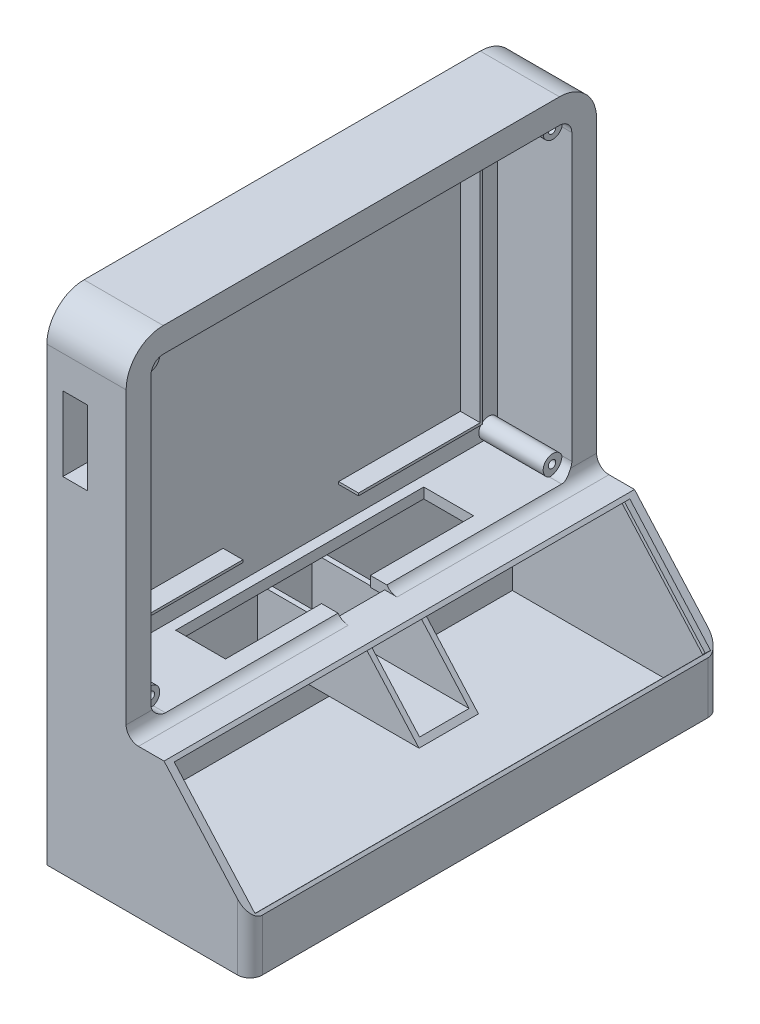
ISO-10303-21;
HEADER;
FILE_DESCRIPTION(('STEP AP214'),'2;1');
FILE_NAME('part.step','',(''),(''),'','','');
FILE_SCHEMA(('AUTOMOTIVE_DESIGN { 1 0 10303 214 1 1 1 1 }'));
ENDSEC;
DATA;
#1=APPLICATION_CONTEXT('core data for automotive mechanical design processes');
#2=APPLICATION_PROTOCOL_DEFINITION('international standard','automotive_design',2000,#1);
#3=PRODUCT_CONTEXT('',#1,'mechanical');
#4=PRODUCT('Part','Part','',(#3));
#5=PRODUCT_RELATED_PRODUCT_CATEGORY('part','',(#4));
#6=PRODUCT_DEFINITION_FORMATION('','',#4);
#7=PRODUCT_DEFINITION_CONTEXT('part definition',#1,'design');
#8=PRODUCT_DEFINITION('design','',#6,#7);
#9=PRODUCT_DEFINITION_SHAPE('','',#8);
#10=(LENGTH_UNIT() NAMED_UNIT(*) SI_UNIT(.MILLI.,.METRE.));
#11=(NAMED_UNIT(*) PLANE_ANGLE_UNIT() SI_UNIT($,.RADIAN.));
#12=(NAMED_UNIT(*) SI_UNIT($,.STERADIAN.) SOLID_ANGLE_UNIT());
#13=UNCERTAINTY_MEASURE_WITH_UNIT(LENGTH_MEASURE(1.E-05),#10,'distance_accuracy_value','');
#14=(GEOMETRIC_REPRESENTATION_CONTEXT(3) GLOBAL_UNCERTAINTY_ASSIGNED_CONTEXT((#13)) GLOBAL_UNIT_ASSIGNED_CONTEXT((#10,
#11,#12)) REPRESENTATION_CONTEXT('',''));
#15=CARTESIAN_POINT('',(0.,0.,0.));
#16=DIRECTION('',(0.,0.,1.));
#17=DIRECTION('',(1.,0.,0.));
#18=AXIS2_PLACEMENT_3D('',#15,#16,#17);
#19=CARTESIAN_POINT('',(8.,0.,0.));
#20=DIRECTION('',(-1.,0.,0.));
#21=DIRECTION('',(0.,0.,1.));
#22=AXIS2_PLACEMENT_3D('',#19,#20,#21);
#23=PLANE('',#22);
#24=DIRECTION('',(0.,0.,-1.));
#25=VECTOR('',#24,1.);
#26=CARTESIAN_POINT('',(8.,-48.5,71.));
#27=LINE('',#26,#25);
#28=CARTESIAN_POINT('',(8.,-48.5,71.));
#29=VERTEX_POINT('',#28);
#30=CARTESIAN_POINT('',(8.,-48.5,25.840589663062));
#31=VERTEX_POINT('',#30);
#32=EDGE_CURVE('E698',#29,#31,#27,.T.);
#33=ORIENTED_EDGE('',*,*,#32,.T.);
#34=DIRECTION('',(0.,1.,0.));
#35=VECTOR('',#34,1.);
#36=CARTESIAN_POINT('',(8.,-55.5,25.840589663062));
#37=LINE('',#36,#35);
#38=CARTESIAN_POINT('',(8.,-47.5,25.840589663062));
#39=VERTEX_POINT('',#38);
#40=EDGE_CURVE('E588',#31,#39,#37,.T.);
#41=ORIENTED_EDGE('',*,*,#40,.T.);
#42=DIRECTION('',(0.,0.,-1.));
#43=VECTOR('',#42,1.);
#44=CARTESIAN_POINT('',(8.,-47.5,70.));
#45=LINE('',#44,#43);
#46=CARTESIAN_POINT('',(8.,-47.5,70.));
#47=VERTEX_POINT('',#46);
#48=EDGE_CURVE('E651',#47,#39,#45,.T.);
#49=ORIENTED_EDGE('',*,*,#48,.F.);
#50=DIRECTION('',(0.,-1.,0.));
#51=VECTOR('',#50,1.);
#52=CARTESIAN_POINT('',(8.,47.5,70.));
#53=LINE('',#52,#51);
#54=CARTESIAN_POINT('',(8.,7.13932251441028,70.));
#55=VERTEX_POINT('',#54);
#56=EDGE_CURVE('E645',#55,#47,#53,.T.);
#57=ORIENTED_EDGE('',*,*,#56,.F.);
#58=DIRECTION('',(0.,0.,-1.));
#59=VECTOR('',#58,1.);
#60=CARTESIAN_POINT('',(8.,7.13932251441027,78.));
#61=LINE('',#60,#59);
#62=CARTESIAN_POINT('',(8.,7.13932251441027,71.));
#63=VERTEX_POINT('',#62);
#64=EDGE_CURVE('E615',#63,#55,#61,.T.);
#65=ORIENTED_EDGE('',*,*,#64,.F.);
#66=DIRECTION('',(0.,-1.,0.));
#67=VECTOR('',#66,1.);
#68=CARTESIAN_POINT('',(8.,48.5,71.));
#69=LINE('',#68,#67);
#70=EDGE_CURVE('E691',#63,#29,#69,.T.);
#71=ORIENTED_EDGE('',*,*,#70,.T.);
#72=EDGE_LOOP('',(#33,#41,#49,#57,#65,#71));
#73=FACE_BOUND('',#72,.T.);
#74=ADVANCED_FACE('F49',(#73),#23,.F.);
#75=CARTESIAN_POINT('',(8.,-48.5,71.));
#76=DIRECTION('',(0.,1.,0.));
#77=DIRECTION('',(0.,0.,1.));
#78=AXIS2_PLACEMENT_3D('',#75,#76,#77);
#79=PLANE('',#78);
#80=DIRECTION('',(0.,0.,-1.));
#81=VECTOR('',#80,1.);
#82=CARTESIAN_POINT('',(0.,-48.5,71.));
#83=LINE('',#82,#81);
#84=CARTESIAN_POINT('',(0.,-48.5,71.));
#85=VERTEX_POINT('',#84);
#86=CARTESIAN_POINT('',(0.,-48.5,25.840589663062));
#87=VERTEX_POINT('',#86);
#88=EDGE_CURVE('E715',#85,#87,#83,.T.);
#89=ORIENTED_EDGE('',*,*,#88,.T.);
#90=DIRECTION('',(1.,0.,0.));
#91=VECTOR('',#90,1.);
#92=CARTESIAN_POINT('',(8.,-48.5,25.840589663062));
#93=LINE('',#92,#91);
#94=EDGE_CURVE('E605',#87,#31,#93,.T.);
#95=ORIENTED_EDGE('',*,*,#94,.T.);
#96=ORIENTED_EDGE('',*,*,#32,.F.);
#97=DIRECTION('',(-1.,0.,0.));
#98=VECTOR('',#97,1.);
#99=CARTESIAN_POINT('',(8.,-48.5,71.));
#100=LINE('',#99,#98);
#101=EDGE_CURVE('E729',#29,#85,#100,.T.);
#102=ORIENTED_EDGE('',*,*,#101,.T.);
#103=EDGE_LOOP('',(#89,#95,#96,#102));
#104=FACE_BOUND('',#103,.T.);
#105=ADVANCED_FACE('F1483',(#104),#79,.F.);
#106=CARTESIAN_POINT('',(8.,-47.5,70.));
#107=DIRECTION('',(0.,1.,0.));
#108=DIRECTION('',(0.,0.,1.));
#109=AXIS2_PLACEMENT_3D('',#106,#107,#108);
#110=PLANE('',#109);
#111=DIRECTION('',(1.,0.,0.));
#112=VECTOR('',#111,1.);
#113=CARTESIAN_POINT('',(8.,-47.5,25.840589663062));
#114=LINE('',#113,#112);
#115=CARTESIAN_POINT('',(0.,-47.5,25.840589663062));
#116=VERTEX_POINT('',#115);
#117=EDGE_CURVE('E584',#116,#39,#114,.T.);
#118=ORIENTED_EDGE('',*,*,#117,.F.);
#119=DIRECTION('',(0.,0.,-1.));
#120=VECTOR('',#119,1.);
#121=CARTESIAN_POINT('',(0.,-47.5,70.));
#122=LINE('',#121,#120);
#123=CARTESIAN_POINT('',(0.,-47.5,70.));
#124=VERTEX_POINT('',#123);
#125=EDGE_CURVE('E642',#124,#116,#122,.T.);
#126=ORIENTED_EDGE('',*,*,#125,.F.);
#127=DIRECTION('',(-1.,0.,0.));
#128=VECTOR('',#127,1.);
#129=CARTESIAN_POINT('',(8.,-47.5,70.));
#130=LINE('',#129,#128);
#131=EDGE_CURVE('E675',#47,#124,#130,.T.);
#132=ORIENTED_EDGE('',*,*,#131,.F.);
#133=ORIENTED_EDGE('',*,*,#48,.T.);
#134=EDGE_LOOP('',(#118,#126,#132,#133));
#135=FACE_BOUND('',#134,.T.);
#136=ADVANCED_FACE('F1491',(#135),#110,.T.);
#137=CARTESIAN_POINT('',(8.,48.5,71.));
#138=DIRECTION('',(0.,0.,-1.));
#139=DIRECTION('',(-1.,0.,0.));
#140=AXIS2_PLACEMENT_3D('',#137,#138,#139);
#141=PLANE('',#140);
#142=DIRECTION('',(0.,-1.,0.));
#143=VECTOR('',#142,1.);
#144=CARTESIAN_POINT('',(0.,48.5,71.));
#145=LINE('',#144,#143);
#146=CARTESIAN_POINT('',(0.,48.5,71.));
#147=VERTEX_POINT('',#146);
#148=CARTESIAN_POINT('',(0.,41.0342333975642,71.));
#149=VERTEX_POINT('',#148);
#150=EDGE_CURVE('E710',#147,#149,#145,.T.);
#151=ORIENTED_EDGE('',*,*,#150,.T.);
#152=DIRECTION('',(1.,0.,0.));
#153=VECTOR('',#152,1.);
#154=CARTESIAN_POINT('',(8.,41.0342333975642,71.));
#155=LINE('',#154,#153);
#156=CARTESIAN_POINT('',(8.,41.0342333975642,71.));
#157=VERTEX_POINT('',#156);
#158=EDGE_CURVE('E633',#149,#157,#155,.T.);
#159=ORIENTED_EDGE('',*,*,#158,.T.);
#160=CARTESIAN_POINT('',(8.,48.5,71.));
#161=VERTEX_POINT('',#160);
#162=EDGE_CURVE('E693',#161,#157,#69,.T.);
#163=ORIENTED_EDGE('',*,*,#162,.F.);
#164=DIRECTION('',(-1.,0.,0.));
#165=VECTOR('',#164,1.);
#166=CARTESIAN_POINT('',(8.,48.5,71.));
#167=LINE('',#166,#165);
#168=EDGE_CURVE('E733',#161,#147,#167,.T.);
#169=ORIENTED_EDGE('',*,*,#168,.T.);
#170=EDGE_LOOP('',(#151,#159,#163,#169));
#171=FACE_BOUND('',#170,.T.);
#172=ADVANCED_FACE('F1667',(#171),#141,.F.);
#173=CARTESIAN_POINT('',(8.,47.5,70.));
#174=DIRECTION('',(0.,0.,-1.));
#175=DIRECTION('',(0.,1.,0.));
#176=AXIS2_PLACEMENT_3D('',#173,#174,#175);
#177=PLANE('',#176);
#178=DIRECTION('',(1.,0.,0.));
#179=VECTOR('',#178,1.);
#180=CARTESIAN_POINT('',(8.,41.0342333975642,70.));
#181=LINE('',#180,#179);
#182=CARTESIAN_POINT('',(0.,41.0342333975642,70.));
#183=VERTEX_POINT('',#182);
#184=CARTESIAN_POINT('',(8.,41.0342333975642,70.));
#185=VERTEX_POINT('',#184);
#186=EDGE_CURVE('E612',#183,#185,#181,.T.);
#187=ORIENTED_EDGE('',*,*,#186,.F.);
#188=DIRECTION('',(0.,-1.,0.));
#189=VECTOR('',#188,1.);
#190=CARTESIAN_POINT('',(0.,47.5,70.));
#191=LINE('',#190,#189);
#192=CARTESIAN_POINT('',(0.,47.5,70.));
#193=VERTEX_POINT('',#192);
#194=EDGE_CURVE('E664',#193,#183,#191,.T.);
#195=ORIENTED_EDGE('',*,*,#194,.F.);
#196=DIRECTION('',(-1.,0.,0.));
#197=VECTOR('',#196,1.);
#198=CARTESIAN_POINT('',(8.,47.5,70.));
#199=LINE('',#198,#197);
#200=CARTESIAN_POINT('',(8.,47.5,70.));
#201=VERTEX_POINT('',#200);
#202=EDGE_CURVE('E679',#201,#193,#199,.T.);
#203=ORIENTED_EDGE('',*,*,#202,.F.);
#204=EDGE_CURVE('E646',#201,#185,#53,.T.);
#205=ORIENTED_EDGE('',*,*,#204,.T.);
#206=EDGE_LOOP('',(#187,#195,#203,#205));
#207=FACE_BOUND('',#206,.T.);
#208=ADVANCED_FACE('F1643',(#207),#177,.T.);
#209=CARTESIAN_POINT('',(24.2045351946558,-82.5,-51.1391691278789));
#210=DIRECTION('',(1.,0.,0.));
#211=DIRECTION('',(0.,0.,-1.));
#212=AXIS2_PLACEMENT_3D('',#209,#210,#211);
#213=PLANE('',#212);
#214=DIRECTION('',(0.,0.,-1.));
#215=VECTOR('',#214,1.);
#216=CARTESIAN_POINT('',(24.2045351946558,-66.6749819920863,91.));
#217=LINE('',#216,#215);
#218=CARTESIAN_POINT('',(24.2045351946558,-66.6749819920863,-9.43068998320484));
#219=VERTEX_POINT('',#218);
#220=CARTESIAN_POINT('',(24.2045351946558,-66.6749819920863,-9.99999999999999));
#221=VERTEX_POINT('',#220);
#222=EDGE_CURVE('E1280',#219,#221,#217,.T.);
#223=ORIENTED_EDGE('',*,*,#222,.F.);
#224=DIRECTION('',(0.,1.,0.));
#225=VECTOR('',#224,1.);
#226=CARTESIAN_POINT('',(24.2045351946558,-82.5,-9.43068998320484));
#227=LINE('',#226,#225);
#228=CARTESIAN_POINT('',(24.2045351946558,-62.5,-9.43068998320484));
#229=VERTEX_POINT('',#228);
#230=EDGE_CURVE('E1300',#219,#229,#227,.T.);
#231=ORIENTED_EDGE('',*,*,#230,.T.);
#232=DIRECTION('',(0.,0.,-1.));
#233=VECTOR('',#232,1.);
#234=CARTESIAN_POINT('',(24.2045351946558,-62.5,-51.1391691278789));
#235=LINE('',#234,#233);
#236=CARTESIAN_POINT('',(24.2045351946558,-62.5,-51.1391691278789));
#237=VERTEX_POINT('',#236);
#238=EDGE_CURVE('E888',#229,#237,#235,.T.);
#239=ORIENTED_EDGE('',*,*,#238,.T.);
#240=DIRECTION('',(0.,1.,0.));
#241=VECTOR('',#240,1.);
#242=CARTESIAN_POINT('',(24.2045351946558,-82.5,-51.1391691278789));
#243=LINE('',#242,#241);
#244=CARTESIAN_POINT('',(24.2045351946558,-66.6749819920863,-51.1391691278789));
#245=VERTEX_POINT('',#244);
#246=EDGE_CURVE('E902',#245,#237,#243,.T.);
#247=ORIENTED_EDGE('',*,*,#246,.F.);
#248=CARTESIAN_POINT('',(24.2045351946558,-66.6749819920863,-12.));
#249=VERTEX_POINT('',#248);
#250=EDGE_CURVE('E1273',#249,#245,#217,.T.);
#251=ORIENTED_EDGE('',*,*,#250,.F.);
#252=EDGE_CURVE('E1587',#221,#249,#217,.T.);
#253=ORIENTED_EDGE('',*,*,#252,.F.);
#254=EDGE_LOOP('',(#223,#231,#239,#247,#251,#253));
#255=FACE_BOUND('',#254,.T.);
#256=ADVANCED_FACE('F1675',(#255),#213,.F.);
#257=CARTESIAN_POINT('',(0.,57.5,-80.));
#258=DIRECTION('',(-1.,0.,0.));
#259=DIRECTION('',(0.,0.,1.));
#260=AXIS2_PLACEMENT_3D('',#257,#258,#259);
#261=PLANE('',#260);
#262=DIRECTION('',(0.,1.,0.));
#263=VECTOR('',#262,1.);
#264=CARTESIAN_POINT('',(0.,0.,-12.));
#265=LINE('',#264,#263);
#266=CARTESIAN_POINT('',(0.,-91.6749819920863,-12.));
#267=VERTEX_POINT('',#266);
#268=CARTESIAN_POINT('',(0.,-66.6749819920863,-12.));
#269=VERTEX_POINT('',#268);
#270=EDGE_CURVE('E798',#267,#269,#265,.T.);
#271=ORIENTED_EDGE('',*,*,#270,.F.);
#272=DIRECTION('',(0.,0.,-1.));
#273=VECTOR('',#272,1.);
#274=CARTESIAN_POINT('',(0.,-91.6749819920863,0.));
#275=LINE('',#274,#273);
#276=CARTESIAN_POINT('',(0.,-91.6749819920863,12.));
#277=VERTEX_POINT('',#276);
#278=EDGE_CURVE('E804',#277,#267,#275,.T.);
#279=ORIENTED_EDGE('',*,*,#278,.F.);
#280=DIRECTION('',(0.,-1.,0.));
#281=VECTOR('',#280,1.);
#282=CARTESIAN_POINT('',(0.,0.,12.));
#283=LINE('',#282,#281);
#284=CARTESIAN_POINT('',(0.,-66.6749819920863,12.));
#285=VERTEX_POINT('',#284);
#286=EDGE_CURVE('E783',#285,#277,#283,.T.);
#287=ORIENTED_EDGE('',*,*,#286,.F.);
#288=DIRECTION('',(0.,0.,1.));
#289=VECTOR('',#288,1.);
#290=CARTESIAN_POINT('',(0.,-66.6749819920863,91.));
#291=LINE('',#290,#289);
#292=CARTESIAN_POINT('',(0.,-66.6749819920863,91.));
#293=VERTEX_POINT('',#292);
#294=EDGE_CURVE('E1005',#285,#293,#291,.T.);
#295=ORIENTED_EDGE('',*,*,#294,.T.);
#296=DIRECTION('',(0.,-1.,0.));
#297=VECTOR('',#296,1.);
#298=CARTESIAN_POINT('',(0.,-66.6749819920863,91.));
#299=LINE('',#298,#297);
#300=CARTESIAN_POINT('',(0.,-120.674981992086,91.));
#301=VERTEX_POINT('',#300);
#302=EDGE_CURVE('E1013',#293,#301,#299,.T.);
#303=ORIENTED_EDGE('',*,*,#302,.T.);
#304=DIRECTION('',(0.,0.,-1.));
#305=VECTOR('',#304,1.);
#306=CARTESIAN_POINT('',(0.,-120.674981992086,91.));
#307=LINE('',#306,#305);
#308=CARTESIAN_POINT('',(0.,-120.674981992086,-91.));
#309=VERTEX_POINT('',#308);
#310=EDGE_CURVE('E1021',#301,#309,#307,.T.);
#311=ORIENTED_EDGE('',*,*,#310,.T.);
#312=DIRECTION('',(0.,1.,0.));
#313=VECTOR('',#312,1.);
#314=CARTESIAN_POINT('',(0.,-66.6749819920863,-91.));
#315=LINE('',#314,#313);
#316=CARTESIAN_POINT('',(0.,-66.6749819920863,-91.));
#317=VERTEX_POINT('',#316);
#318=EDGE_CURVE('E1015',#309,#317,#315,.T.);
#319=ORIENTED_EDGE('',*,*,#318,.T.);
#320=EDGE_CURVE('E1009',#317,#269,#291,.T.);
#321=ORIENTED_EDGE('',*,*,#320,.T.);
#322=EDGE_LOOP('',(#271,#279,#287,#295,#303,#311,#319,#321));
#323=FACE_BOUND('',#322,.T.);
#324=ADVANCED_FACE('F1681',(#323),#261,.F.);
#325=CARTESIAN_POINT('',(-189.842039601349,-66.6749819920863,91.));
#326=DIRECTION('',(0.,1.,0.));
#327=DIRECTION('',(0.,0.,1.));
#328=AXIS2_PLACEMENT_3D('',#325,#326,#327);
#329=PLANE('',#328);
#330=DIRECTION('',(0.,0.,-1.));
#331=VECTOR('',#330,1.);
#332=CARTESIAN_POINT('',(30.,-66.6749819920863,91.));
#333=LINE('',#332,#331);
#334=CARTESIAN_POINT('',(30.,-66.6749819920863,10.));
#335=VERTEX_POINT('',#334);
#336=CARTESIAN_POINT('',(30.,-66.6749819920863,-9.43068998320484));
#337=VERTEX_POINT('',#336);
#338=EDGE_CURVE('E758',#335,#337,#333,.T.);
#339=ORIENTED_EDGE('',*,*,#338,.T.);
#340=DIRECTION('',(-1.,0.,0.));
#341=VECTOR('',#340,1.);
#342=CARTESIAN_POINT('',(-189.842039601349,-66.6749819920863,-9.43068998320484));
#343=LINE('',#342,#341);
#344=EDGE_CURVE('E778',#337,#219,#343,.T.);
#345=ORIENTED_EDGE('',*,*,#344,.T.);
#346=ORIENTED_EDGE('',*,*,#222,.T.);
#347=DIRECTION('',(-1.,0.,0.));
#348=VECTOR('',#347,1.);
#349=CARTESIAN_POINT('',(94.6962359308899,-66.6749819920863,-10.));
#350=LINE('',#349,#348);
#351=CARTESIAN_POINT('',(43.076126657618,-66.6749819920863,-9.99999999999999));
#352=VERTEX_POINT('',#351);
#353=EDGE_CURVE('E822',#352,#221,#350,.T.);
#354=ORIENTED_EDGE('',*,*,#353,.F.);
#355=DIRECTION('',(0.,0.,1.));
#356=VECTOR('',#355,1.);
#357=CARTESIAN_POINT('',(43.076126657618,-66.6749819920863,0.));
#358=LINE('',#357,#356);
#359=CARTESIAN_POINT('',(43.076126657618,-66.6749819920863,-12.));
#360=VERTEX_POINT('',#359);
#361=EDGE_CURVE('E813',#360,#352,#358,.T.);
#362=ORIENTED_EDGE('',*,*,#361,.F.);
#363=DIRECTION('',(-1.,0.,0.));
#364=VECTOR('',#363,1.);
#365=CARTESIAN_POINT('',(94.6962359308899,-66.6749819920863,-12.));
#366=LINE('',#365,#364);
#367=EDGE_CURVE('E828',#360,#249,#366,.T.);
#368=ORIENTED_EDGE('',*,*,#367,.T.);
#369=ORIENTED_EDGE('',*,*,#250,.T.);
#370=DIRECTION('',(-1.,0.,0.));
#371=VECTOR('',#370,1.);
#372=CARTESIAN_POINT('',(-189.842039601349,-66.6749819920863,-51.1391691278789));
#373=LINE('',#372,#371);
#374=CARTESIAN_POINT('',(4.06259967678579,-66.6749819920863,-51.1391691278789));
#375=VERTEX_POINT('',#374);
#376=EDGE_CURVE('E1278',#245,#375,#373,.T.);
#377=ORIENTED_EDGE('',*,*,#376,.T.);
#378=DIRECTION('',(0.,0.,1.));
#379=VECTOR('',#378,1.);
#380=CARTESIAN_POINT('',(4.06259967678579,-66.6749819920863,91.));
#381=LINE('',#380,#379);
#382=CARTESIAN_POINT('',(4.06259967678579,-66.6749819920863,-12.));
#383=VERTEX_POINT('',#382);
#384=EDGE_CURVE('E1285',#375,#383,#381,.T.);
#385=ORIENTED_EDGE('',*,*,#384,.T.);
#386=EDGE_CURVE('E802',#383,#269,#366,.T.);
#387=ORIENTED_EDGE('',*,*,#386,.T.);
#388=ORIENTED_EDGE('',*,*,#320,.F.);
#389=DIRECTION('',(-1.,0.,0.));
#390=VECTOR('',#389,1.);
#391=CARTESIAN_POINT('',(48.8255113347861,-66.6749819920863,-91.));
#392=LINE('',#391,#390);
#393=CARTESIAN_POINT('',(45.584493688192,-66.6749819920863,-91.));
#394=VERTEX_POINT('',#393);
#395=EDGE_CURVE('E1214',#394,#317,#392,.T.);
#396=ORIENTED_EDGE('',*,*,#395,.F.);
#397=DIRECTION('',(0.,0.,1.));
#398=VECTOR('',#397,1.);
#399=CARTESIAN_POINT('',(45.584493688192,-66.6749819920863,91.));
#400=LINE('',#399,#398);
#401=CARTESIAN_POINT('',(45.584493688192,-66.6749819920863,91.));
#402=VERTEX_POINT('',#401);
#403=EDGE_CURVE('E967',#394,#402,#400,.T.);
#404=ORIENTED_EDGE('',*,*,#403,.T.);
#405=DIRECTION('',(1.,0.,0.));
#406=VECTOR('',#405,1.);
#407=CARTESIAN_POINT('',(48.8255113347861,-66.6749819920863,91.));
#408=LINE('',#407,#406);
#409=EDGE_CURVE('E1254',#293,#402,#408,.T.);
#410=ORIENTED_EDGE('',*,*,#409,.F.);
#411=ORIENTED_EDGE('',*,*,#294,.F.);
#412=DIRECTION('',(-1.,0.,0.));
#413=VECTOR('',#412,1.);
#414=CARTESIAN_POINT('',(94.6962359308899,-66.6749819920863,12.));
#415=LINE('',#414,#413);
#416=CARTESIAN_POINT('',(4.06259967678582,-66.6749819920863,12.));
#417=VERTEX_POINT('',#416);
#418=EDGE_CURVE('E865',#417,#285,#415,.T.);
#419=ORIENTED_EDGE('',*,*,#418,.F.);
#420=CARTESIAN_POINT('',(4.06259967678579,-66.6749819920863,49.0656448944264));
#421=VERTEX_POINT('',#420);
#422=EDGE_CURVE('E1284',#417,#421,#381,.T.);
#423=ORIENTED_EDGE('',*,*,#422,.T.);
#424=DIRECTION('',(1.,0.,0.));
#425=VECTOR('',#424,1.);
#426=CARTESIAN_POINT('',(-189.842039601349,-66.6749819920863,49.0656448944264));
#427=LINE('',#426,#425);
#428=CARTESIAN_POINT('',(24.2045351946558,-66.6749819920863,49.0656448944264));
#429=VERTEX_POINT('',#428);
#430=EDGE_CURVE('E1269',#421,#429,#427,.T.);
#431=ORIENTED_EDGE('',*,*,#430,.T.);
#432=CARTESIAN_POINT('',(24.2045351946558,-66.6749819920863,12.));
#433=VERTEX_POINT('',#432);
#434=EDGE_CURVE('E1274',#429,#433,#217,.T.);
#435=ORIENTED_EDGE('',*,*,#434,.T.);
#436=CARTESIAN_POINT('',(43.076126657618,-66.6749819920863,12.));
#437=VERTEX_POINT('',#436);
#438=EDGE_CURVE('E788',#437,#433,#415,.T.);
#439=ORIENTED_EDGE('',*,*,#438,.F.);
#440=DIRECTION('',(0.,0.,1.));
#441=VECTOR('',#440,1.);
#442=CARTESIAN_POINT('',(43.076126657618,-66.6749819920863,0.));
#443=LINE('',#442,#441);
#444=CARTESIAN_POINT('',(43.076126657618,-66.6749819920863,9.99999999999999));
#445=VERTEX_POINT('',#444);
#446=EDGE_CURVE('E808',#445,#437,#443,.T.);
#447=ORIENTED_EDGE('',*,*,#446,.F.);
#448=DIRECTION('',(-1.,0.,0.));
#449=VECTOR('',#448,1.);
#450=CARTESIAN_POINT('',(94.6962359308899,-66.6749819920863,10.));
#451=LINE('',#450,#449);
#452=EDGE_CURVE('E861',#445,#335,#451,.T.);
#453=ORIENTED_EDGE('',*,*,#452,.T.);
#454=EDGE_LOOP('',(#339,#345,#346,#354,#362,#368,#369,#377,#385,#387,#388,#396,#404,#410,#411,
#419,#423,#431,#435,#439,#447,#453));
#455=FACE_BOUND('',#454,.T.);
#456=ADVANCED_FACE('F2123',(#455),#329,.F.);
#457=CARTESIAN_POINT('',(0.,-66.6749819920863,-9.99999999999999));
#458=VERTEX_POINT('',#457);
#459=CARTESIAN_POINT('',(0.,-66.6749819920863,9.99999999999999));
#460=VERTEX_POINT('',#459);
#461=EDGE_CURVE('E1014',#458,#460,#291,.T.);
#462=ORIENTED_EDGE('',*,*,#461,.F.);
#463=CARTESIAN_POINT('',(4.06259967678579,-66.6749819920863,-9.99999999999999));
#464=VERTEX_POINT('',#463);
#465=EDGE_CURVE('E827',#464,#458,#350,.T.);
#466=ORIENTED_EDGE('',*,*,#465,.F.);
#467=CARTESIAN_POINT('',(4.06259967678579,-66.6749819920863,9.99999999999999));
#468=VERTEX_POINT('',#467);
#469=EDGE_CURVE('E1290',#464,#468,#381,.T.);
#470=ORIENTED_EDGE('',*,*,#469,.T.);
#471=EDGE_CURVE('E860',#468,#460,#451,.T.);
#472=ORIENTED_EDGE('',*,*,#471,.T.);
#473=EDGE_LOOP('',(#462,#466,#470,#472));
#474=FACE_BOUND('',#473,.T.);
#475=ADVANCED_FACE('F1417',(#474),#329,.F.);
#476=CARTESIAN_POINT('',(30.,0.,0.));
#477=DIRECTION('',(1.,0.,0.));
#478=DIRECTION('',(0.,0.,-1.));
#479=AXIS2_PLACEMENT_3D('',#476,#477,#478);
#480=PLANE('',#479);
#481=CARTESIAN_POINT('',(30.,-57.5,-80.));
#482=DIRECTION('',(1.,0.,0.));
#483=DIRECTION('',(0.,0.,-1.));
#484=AXIS2_PLACEMENT_3D('',#481,#482,#483);
#485=CIRCLE('',#484,5.00000000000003);
#486=CARTESIAN_POINT('',(30.,-59.6749819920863,-84.5021609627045));
#487=VERTEX_POINT('',#486);
#488=CARTESIAN_POINT('',(30.,-57.5,-85.));
#489=VERTEX_POINT('',#488);
#490=EDGE_CURVE('E1095',#487,#489,#485,.T.);
#491=ORIENTED_EDGE('',*,*,#490,.F.);
#492=DIRECTION('',(0.,0.,1.));
#493=VECTOR('',#492,1.);
#494=CARTESIAN_POINT('',(30.,-59.6749819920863,0.));
#495=LINE('',#494,#493);
#496=CARTESIAN_POINT('',(30.,-59.6749819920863,-95.));
#497=VERTEX_POINT('',#496);
#498=EDGE_CURVE('E1322',#487,#497,#495,.F.);
#499=ORIENTED_EDGE('',*,*,#498,.T.);
#500=DIRECTION('',(0.,-1.,0.));
#501=VECTOR('',#500,1.);
#502=CARTESIAN_POINT('',(30.,0.,-95.));
#503=LINE('',#502,#501);
#504=CARTESIAN_POINT('',(30.,57.4999999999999,-95.));
#505=VERTEX_POINT('',#504);
#506=EDGE_CURVE('E1152',#505,#497,#503,.T.);
#507=ORIENTED_EDGE('',*,*,#506,.F.);
#508=CARTESIAN_POINT('',(30.,57.5,-80.));
#509=DIRECTION('',(1.,0.,0.));
#510=DIRECTION('',(0.,0.,-1.));
#511=AXIS2_PLACEMENT_3D('',#508,#509,#510);
#512=CIRCLE('',#511,15.);
#513=CARTESIAN_POINT('',(30.,72.5,-79.9999999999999));
#514=VERTEX_POINT('',#513);
#515=EDGE_CURVE('E1156',#514,#505,#512,.F.);
#516=ORIENTED_EDGE('',*,*,#515,.F.);
#517=DIRECTION('',(0.,0.,-1.));
#518=VECTOR('',#517,1.);
#519=CARTESIAN_POINT('',(30.,72.5,0.));
#520=LINE('',#519,#518);
#521=CARTESIAN_POINT('',(30.,72.5,80.));
#522=VERTEX_POINT('',#521);
#523=EDGE_CURVE('E1140',#522,#514,#520,.T.);
#524=ORIENTED_EDGE('',*,*,#523,.F.);
#525=CARTESIAN_POINT('',(30.,57.5,80.));
#526=DIRECTION('',(1.,0.,0.));
#527=DIRECTION('',(0.,0.,-1.));
#528=AXIS2_PLACEMENT_3D('',#525,#526,#527);
#529=CIRCLE('',#528,15.);
#530=CARTESIAN_POINT('',(30.,57.5,95.));
#531=VERTEX_POINT('',#530);
#532=EDGE_CURVE('E1144',#522,#531,#529,.T.);
#533=ORIENTED_EDGE('',*,*,#532,.T.);
#534=DIRECTION('',(0.,-1.,0.));
#535=VECTOR('',#534,1.);
#536=CARTESIAN_POINT('',(30.,0.,95.));
#537=LINE('',#536,#535);
#538=CARTESIAN_POINT('',(30.,-59.6749819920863,95.));
#539=VERTEX_POINT('',#538);
#540=EDGE_CURVE('E1148',#531,#539,#537,.T.);
#541=ORIENTED_EDGE('',*,*,#540,.T.);
#542=DIRECTION('',(0.,0.,1.));
#543=VECTOR('',#542,1.);
#544=CARTESIAN_POINT('',(30.,-59.6749819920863,0.));
#545=LINE('',#544,#543);
#546=CARTESIAN_POINT('',(30.,-59.6749819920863,84.5021609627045));
#547=VERTEX_POINT('',#546);
#548=EDGE_CURVE('E1319',#539,#547,#545,.F.);
#549=ORIENTED_EDGE('',*,*,#548,.T.);
#550=CARTESIAN_POINT('',(30.,-57.5,80.));
#551=DIRECTION('',(1.,0.,0.));
#552=DIRECTION('',(0.,0.,-1.));
#553=AXIS2_PLACEMENT_3D('',#550,#551,#552);
#554=CIRCLE('',#553,5.00000000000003);
#555=CARTESIAN_POINT('',(30.,-57.5,85.));
#556=VERTEX_POINT('',#555);
#557=EDGE_CURVE('E1090',#556,#547,#554,.T.);
#558=ORIENTED_EDGE('',*,*,#557,.F.);
#559=DIRECTION('',(0.,-1.,0.));
#560=VECTOR('',#559,1.);
#561=CARTESIAN_POINT('',(30.,0.,85.));
#562=LINE('',#561,#560);
#563=CARTESIAN_POINT('',(30.,57.5,85.));
#564=VERTEX_POINT('',#563);
#565=EDGE_CURVE('E1127',#564,#556,#562,.T.);
#566=ORIENTED_EDGE('',*,*,#565,.F.);
#567=CARTESIAN_POINT('',(30.,57.5,80.));
#568=DIRECTION('',(1.,0.,0.));
#569=DIRECTION('',(0.,0.,1.));
#570=AXIS2_PLACEMENT_3D('',#567,#568,#569);
#571=CIRCLE('',#570,5.00000000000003);
#572=CARTESIAN_POINT('',(30.,62.5,80.));
#573=VERTEX_POINT('',#572);
#574=EDGE_CURVE('E1087',#573,#564,#571,.T.);
#575=ORIENTED_EDGE('',*,*,#574,.F.);
#576=DIRECTION('',(0.,0.,-1.));
#577=VECTOR('',#576,1.);
#578=CARTESIAN_POINT('',(30.,62.5,0.));
#579=LINE('',#578,#577);
#580=CARTESIAN_POINT('',(30.,62.5,-79.9999999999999));
#581=VERTEX_POINT('',#580);
#582=EDGE_CURVE('E1131',#573,#581,#579,.T.);
#583=ORIENTED_EDGE('',*,*,#582,.T.);
#584=CARTESIAN_POINT('',(30.,57.5,-79.9999999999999));
#585=DIRECTION('',(1.,0.,0.));
#586=DIRECTION('',(0.,0.,1.));
#587=AXIS2_PLACEMENT_3D('',#584,#585,#586);
#588=CIRCLE('',#587,5.00000000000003);
#589=CARTESIAN_POINT('',(30.,57.5,-85.));
#590=VERTEX_POINT('',#589);
#591=EDGE_CURVE('E1074',#590,#581,#588,.T.);
#592=ORIENTED_EDGE('',*,*,#591,.F.);
#593=DIRECTION('',(0.,-1.,0.));
#594=VECTOR('',#593,1.);
#595=CARTESIAN_POINT('',(30.,0.,-85.));
#596=LINE('',#595,#594);
#597=EDGE_CURVE('E1136',#590,#489,#596,.T.);
#598=ORIENTED_EDGE('',*,*,#597,.T.);
#599=EDGE_LOOP('',(#491,#499,#507,#516,#524,#533,#541,#549,#558,#566,#575,#583,#592,#598));
#600=FACE_BOUND('',#599,.T.);
#601=ADVANCED_FACE('F1413',(#600),#480,.T.);
#602=CARTESIAN_POINT('',(30.,72.5,0.));
#603=DIRECTION('',(0.,1.,0.));
#604=DIRECTION('',(0.,0.,1.));
#605=AXIS2_PLACEMENT_3D('',#602,#603,#604);
#606=PLANE('',#605);
#607=DIRECTION('',(-1.,0.,0.));
#608=VECTOR('',#607,1.);
#609=CARTESIAN_POINT('',(30.,72.5,-79.9999999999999));
#610=LINE('',#609,#608);
#611=CARTESIAN_POINT('',(-2.,72.5,-79.9999999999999));
#612=VERTEX_POINT('',#611);
#613=EDGE_CURVE('E1201',#514,#612,#610,.T.);
#614=ORIENTED_EDGE('',*,*,#613,.T.);
#615=DIRECTION('',(0.,0.,-1.));
#616=VECTOR('',#615,1.);
#617=CARTESIAN_POINT('',(-2.,72.5,80.));
#618=LINE('',#617,#616);
#619=CARTESIAN_POINT('',(-2.,72.5,80.));
#620=VERTEX_POINT('',#619);
#621=EDGE_CURVE('E1064',#620,#612,#618,.T.);
#622=ORIENTED_EDGE('',*,*,#621,.F.);
#623=DIRECTION('',(-1.,0.,0.));
#624=VECTOR('',#623,1.);
#625=CARTESIAN_POINT('',(30.,72.5,80.));
#626=LINE('',#625,#624);
#627=EDGE_CURVE('E1211',#522,#620,#626,.T.);
#628=ORIENTED_EDGE('',*,*,#627,.F.);
#629=ORIENTED_EDGE('',*,*,#523,.T.);
#630=EDGE_LOOP('',(#614,#622,#628,#629));
#631=FACE_BOUND('',#630,.T.);
#632=ADVANCED_FACE('F1416',(#631),#606,.T.);
#633=CARTESIAN_POINT('',(30.,57.5,80.));
#634=DIRECTION('',(-1.,0.,0.));
#635=DIRECTION('',(0.,0.,1.));
#636=AXIS2_PLACEMENT_3D('',#633,#634,#635);
#637=CYLINDRICAL_SURFACE('',#636,15.);
#638=ORIENTED_EDGE('',*,*,#627,.T.);
#639=CARTESIAN_POINT('',(-2.,57.5,80.));
#640=DIRECTION('',(-1.,0.,0.));
#641=DIRECTION('',(0.,0.,1.));
#642=AXIS2_PLACEMENT_3D('',#639,#640,#641);
#643=CIRCLE('',#642,15.);
#644=CARTESIAN_POINT('',(-2.,57.5,95.));
#645=VERTEX_POINT('',#644);
#646=EDGE_CURVE('E1060',#645,#620,#643,.T.);
#647=ORIENTED_EDGE('',*,*,#646,.F.);
#648=DIRECTION('',(-1.,0.,0.));
#649=VECTOR('',#648,1.);
#650=CARTESIAN_POINT('',(30.,57.5,95.));
#651=LINE('',#650,#649);
#652=EDGE_CURVE('E1208',#531,#645,#651,.T.);
#653=ORIENTED_EDGE('',*,*,#652,.F.);
#654=ORIENTED_EDGE('',*,*,#532,.F.);
#655=EDGE_LOOP('',(#638,#647,#653,#654));
#656=FACE_BOUND('',#655,.T.);
#657=ADVANCED_FACE('F1446',(#656),#637,.T.);
#658=CARTESIAN_POINT('',(30.,0.,95.));
#659=DIRECTION('',(0.,0.,-1.));
#660=DIRECTION('',(0.,1.,0.));
#661=AXIS2_PLACEMENT_3D('',#658,#659,#660);
#662=PLANE('',#661);
#663=DIRECTION('',(1.,0.,0.));
#664=VECTOR('',#663,1.);
#665=CARTESIAN_POINT('',(4.44129287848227,14.3957218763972,95.));
#666=LINE('',#665,#664);
#667=CARTESIAN_POINT('',(4.44129287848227,14.3957218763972,95.));
#668=VERTEX_POINT('',#667);
#669=CARTESIAN_POINT('',(14.4412928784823,14.3957218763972,95.));
#670=VERTEX_POINT('',#669);
#671=EDGE_CURVE('E559',#668,#670,#666,.T.);
#672=ORIENTED_EDGE('',*,*,#671,.F.);
#673=DIRECTION('',(0.,-1.,0.));
#674=VECTOR('',#673,1.);
#675=CARTESIAN_POINT('',(4.44129287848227,44.3957218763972,95.));
#676=LINE('',#675,#674);
#677=CARTESIAN_POINT('',(4.44129287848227,44.3957218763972,95.));
#678=VERTEX_POINT('',#677);
#679=EDGE_CURVE('E65',#678,#668,#676,.T.);
#680=ORIENTED_EDGE('',*,*,#679,.F.);
#681=DIRECTION('',(-1.,0.,0.));
#682=VECTOR('',#681,1.);
#683=CARTESIAN_POINT('',(4.44129287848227,44.3957218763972,95.));
#684=LINE('',#683,#682);
#685=CARTESIAN_POINT('',(14.4412928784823,44.3957218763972,95.));
#686=VERTEX_POINT('',#685);
#687=EDGE_CURVE('E567',#686,#678,#684,.T.);
#688=ORIENTED_EDGE('',*,*,#687,.F.);
#689=DIRECTION('',(0.,1.,0.));
#690=VECTOR('',#689,1.);
#691=CARTESIAN_POINT('',(14.4412928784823,44.3957218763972,95.));
#692=LINE('',#691,#690);
#693=EDGE_CURVE('E549',#670,#686,#692,.T.);
#694=ORIENTED_EDGE('',*,*,#693,.F.);
#695=EDGE_LOOP('',(#672,#680,#688,#694));
#696=FACE_BOUND('',#695,.T.);
#697=DIRECTION('',(-1.,0.,0.));
#698=VECTOR('',#697,1.);
#699=CARTESIAN_POINT('',(231.525378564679,-124.674981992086,95.));
#700=LINE('',#699,#698);
#701=CARTESIAN_POINT('',(75.,-124.674981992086,95.));
#702=VERTEX_POINT('',#701);
#703=CARTESIAN_POINT('',(-2.,-124.674981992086,95.));
#704=VERTEX_POINT('',#703);
#705=EDGE_CURVE('E1043',#702,#704,#700,.T.);
#706=ORIENTED_EDGE('',*,*,#705,.F.);
#707=DIRECTION('',(0.,1.,0.));
#708=VECTOR('',#707,1.);
#709=CARTESIAN_POINT('',(75.,-103.70320008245,95.));
#710=LINE('',#709,#708);
#711=CARTESIAN_POINT('',(75.,-98.0775572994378,95.));
#712=VERTEX_POINT('',#711);
#713=EDGE_CURVE('E1325',#702,#712,#710,.T.);
#714=ORIENTED_EDGE('',*,*,#713,.T.);
#715=DIRECTION('',(0.664321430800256,-0.747447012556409,0.));
#716=VECTOR('',#715,1.);
#717=CARTESIAN_POINT('',(80.,-103.70320008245,95.));
#718=LINE('',#717,#716);
#719=CARTESIAN_POINT('',(45.3122144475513,-64.6749819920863,95.));
#720=VERTEX_POINT('',#719);
#721=EDGE_CURVE('E975',#720,#712,#718,.T.);
#722=ORIENTED_EDGE('',*,*,#721,.F.);
#723=DIRECTION('',(-1.,0.,0.));
#724=VECTOR('',#723,1.);
#725=CARTESIAN_POINT('',(49.,-64.6749819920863,95.));
#726=LINE('',#725,#724);
#727=CARTESIAN_POINT('',(35.,-64.6749819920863,95.));
#728=VERTEX_POINT('',#727);
#729=EDGE_CURVE('E988',#720,#728,#726,.T.);
#730=ORIENTED_EDGE('',*,*,#729,.T.);
#731=CARTESIAN_POINT('',(35.,-59.6749819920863,95.));
#732=DIRECTION('',(0.,0.,-1.));
#733=DIRECTION('',(0.,1.,0.));
#734=AXIS2_PLACEMENT_3D('',#731,#732,#733);
#735=CIRCLE('',#734,5.);
#736=EDGE_CURVE('E1398',#728,#539,#735,.T.);
#737=ORIENTED_EDGE('',*,*,#736,.T.);
#738=ORIENTED_EDGE('',*,*,#540,.F.);
#739=ORIENTED_EDGE('',*,*,#652,.T.);
#740=DIRECTION('',(0.,1.,0.));
#741=VECTOR('',#740,1.);
#742=CARTESIAN_POINT('',(-2.,57.5,95.));
#743=LINE('',#742,#741);
#744=EDGE_CURVE('E1056',#704,#645,#743,.T.);
#745=ORIENTED_EDGE('',*,*,#744,.F.);
#746=EDGE_LOOP('',(#706,#714,#722,#730,#737,#738,#739,#745));
#747=FACE_BOUND('',#746,.T.);
#748=ADVANCED_FACE('F564',(#696,#747),#662,.F.);
#749=CARTESIAN_POINT('',(30.,0.,-95.));
#750=DIRECTION('',(0.,0.,-1.));
#751=DIRECTION('',(0.,1.,0.));
#752=AXIS2_PLACEMENT_3D('',#749,#750,#751);
#753=PLANE('',#752);
#754=DIRECTION('',(0.664321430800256,-0.747447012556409,0.));
#755=VECTOR('',#754,1.);
#756=CARTESIAN_POINT('',(80.,-103.70320008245,-95.));
#757=LINE('',#756,#755);
#758=CARTESIAN_POINT('',(45.3122144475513,-64.6749819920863,-95.));
#759=VERTEX_POINT('',#758);
#760=CARTESIAN_POINT('',(75.,-98.0775572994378,-95.));
#761=VERTEX_POINT('',#760);
#762=EDGE_CURVE('E976',#759,#761,#757,.T.);
#763=ORIENTED_EDGE('',*,*,#762,.T.);
#764=DIRECTION('',(0.,1.,0.));
#765=VECTOR('',#764,1.);
#766=CARTESIAN_POINT('',(75.,0.,-95.));
#767=LINE('',#766,#765);
#768=CARTESIAN_POINT('',(75.,-124.674981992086,-95.));
#769=VERTEX_POINT('',#768);
#770=EDGE_CURVE('E1348',#761,#769,#767,.F.);
#771=ORIENTED_EDGE('',*,*,#770,.T.);
#772=DIRECTION('',(-1.,0.,0.));
#773=VECTOR('',#772,1.);
#774=CARTESIAN_POINT('',(231.525378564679,-124.674981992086,-95.));
#775=LINE('',#774,#773);
#776=CARTESIAN_POINT('',(-2.,-124.674981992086,-95.));
#777=VERTEX_POINT('',#776);
#778=EDGE_CURVE('E1042',#769,#777,#775,.T.);
#779=ORIENTED_EDGE('',*,*,#778,.T.);
#780=DIRECTION('',(0.,-1.,0.));
#781=VECTOR('',#780,1.);
#782=CARTESIAN_POINT('',(-2.,57.4999999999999,-95.));
#783=LINE('',#782,#781);
#784=CARTESIAN_POINT('',(-2.,57.4999999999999,-95.));
#785=VERTEX_POINT('',#784);
#786=EDGE_CURVE('E1052',#785,#777,#783,.T.);
#787=ORIENTED_EDGE('',*,*,#786,.F.);
#788=DIRECTION('',(-1.,0.,0.));
#789=VECTOR('',#788,1.);
#790=CARTESIAN_POINT('',(30.,57.4999999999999,-95.));
#791=LINE('',#790,#789);
#792=EDGE_CURVE('E1204',#505,#785,#791,.T.);
#793=ORIENTED_EDGE('',*,*,#792,.F.);
#794=ORIENTED_EDGE('',*,*,#506,.T.);
#795=CARTESIAN_POINT('',(35.,-59.6749819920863,-95.));
#796=DIRECTION('',(0.,0.,-1.));
#797=DIRECTION('',(0.,1.,0.));
#798=AXIS2_PLACEMENT_3D('',#795,#796,#797);
#799=CIRCLE('',#798,5.);
#800=CARTESIAN_POINT('',(35.,-64.6749819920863,-95.));
#801=VERTEX_POINT('',#800);
#802=EDGE_CURVE('E1368',#497,#801,#799,.F.);
#803=ORIENTED_EDGE('',*,*,#802,.T.);
#804=DIRECTION('',(-1.,0.,0.));
#805=VECTOR('',#804,1.);
#806=CARTESIAN_POINT('',(49.,-64.6749819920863,-95.));
#807=LINE('',#806,#805);
#808=EDGE_CURVE('E994',#759,#801,#807,.T.);
#809=ORIENTED_EDGE('',*,*,#808,.F.);
#810=EDGE_LOOP('',(#763,#771,#779,#787,#793,#794,#803,#809));
#811=FACE_BOUND('',#810,.T.);
#812=ADVANCED_FACE('F1440',(#811),#753,.T.);
#813=CARTESIAN_POINT('',(30.,0.,85.));
#814=DIRECTION('',(0.,0.,-1.));
#815=DIRECTION('',(0.,1.,0.));
#816=AXIS2_PLACEMENT_3D('',#813,#814,#815);
#817=PLANE('',#816);
#818=DIRECTION('',(0.,1.,0.));
#819=VECTOR('',#818,1.);
#820=CARTESIAN_POINT('',(4.44129287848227,0.,85.));
#821=LINE('',#820,#819);
#822=CARTESIAN_POINT('',(4.44129287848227,14.3957218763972,85.));
#823=VERTEX_POINT('',#822);
#824=CARTESIAN_POINT('',(4.44129287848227,44.3957218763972,85.));
#825=VERTEX_POINT('',#824);
#826=EDGE_CURVE('E11',#823,#825,#821,.T.);
#827=ORIENTED_EDGE('',*,*,#826,.F.);
#828=DIRECTION('',(-1.,0.,0.));
#829=VECTOR('',#828,1.);
#830=CARTESIAN_POINT('',(30.,14.3957218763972,85.));
#831=LINE('',#830,#829);
#832=CARTESIAN_POINT('',(14.4412928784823,14.3957218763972,85.));
#833=VERTEX_POINT('',#832);
#834=EDGE_CURVE('E1602',#833,#823,#831,.T.);
#835=ORIENTED_EDGE('',*,*,#834,.F.);
#836=DIRECTION('',(0.,-1.,0.));
#837=VECTOR('',#836,1.);
#838=CARTESIAN_POINT('',(14.4412928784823,0.,85.));
#839=LINE('',#838,#837);
#840=CARTESIAN_POINT('',(14.4412928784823,44.3957218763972,85.));
#841=VERTEX_POINT('',#840);
#842=EDGE_CURVE('E552',#841,#833,#839,.T.);
#843=ORIENTED_EDGE('',*,*,#842,.F.);
#844=DIRECTION('',(1.,0.,0.));
#845=VECTOR('',#844,1.);
#846=CARTESIAN_POINT('',(30.,44.3957218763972,85.));
#847=LINE('',#846,#845);
#848=EDGE_CURVE('E58',#825,#841,#847,.T.);
#849=ORIENTED_EDGE('',*,*,#848,.F.);
#850=EDGE_LOOP('',(#827,#835,#843,#849));
#851=FACE_BOUND('',#850,.T.);
#852=DIRECTION('',(-1.,0.,0.));
#853=VECTOR('',#852,1.);
#854=CARTESIAN_POINT('',(30.,57.5,85.));
#855=LINE('',#854,#853);
#856=CARTESIAN_POINT('',(26.,57.5,85.));
#857=VERTEX_POINT('',#856);
#858=CARTESIAN_POINT('',(0.,57.5,85.));
#859=VERTEX_POINT('',#858);
#860=EDGE_CURVE('E1246',#857,#859,#855,.T.);
#861=ORIENTED_EDGE('',*,*,#860,.F.);
#862=EDGE_CURVE('E1205',#564,#857,#855,.T.);
#863=ORIENTED_EDGE('',*,*,#862,.F.);
#864=ORIENTED_EDGE('',*,*,#565,.T.);
#865=DIRECTION('',(-1.,0.,0.));
#866=VECTOR('',#865,1.);
#867=CARTESIAN_POINT('',(30.,-57.5,85.));
#868=LINE('',#867,#866);
#869=CARTESIAN_POINT('',(26.,-57.5,85.));
#870=VERTEX_POINT('',#869);
#871=EDGE_CURVE('E1215',#556,#870,#868,.T.);
#872=ORIENTED_EDGE('',*,*,#871,.T.);
#873=CARTESIAN_POINT('',(0.,-57.5,85.));
#874=VERTEX_POINT('',#873);
#875=EDGE_CURVE('E1160',#870,#874,#868,.T.);
#876=ORIENTED_EDGE('',*,*,#875,.T.);
#877=DIRECTION('',(0.,-1.,0.));
#878=VECTOR('',#877,1.);
#879=CARTESIAN_POINT('',(0.,0.,85.));
#880=LINE('',#879,#878);
#881=EDGE_CURVE('E1126',#859,#874,#880,.T.);
#882=ORIENTED_EDGE('',*,*,#881,.F.);
#883=EDGE_LOOP('',(#861,#863,#864,#872,#876,#882));
#884=FACE_BOUND('',#883,.T.);
#885=ADVANCED_FACE('F1382',(#851,#884),#817,.T.);
#886=CARTESIAN_POINT('',(30.,58.8310920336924,81.3310920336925));
#887=DIRECTION('',(-1.,0.,0.));
#888=DIRECTION('',(0.,0.,1.));
#889=AXIS2_PLACEMENT_3D('',#886,#887,#888);
#890=CYLINDRICAL_SURFACE('',#889,3.90290810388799);
#891=DIRECTION('',(-1.,0.,0.));
#892=VECTOR('',#891,1.);
#893=CARTESIAN_POINT('',(30.,62.5,80.));
#894=LINE('',#893,#892);
#895=CARTESIAN_POINT('',(26.,62.5,80.));
#896=VERTEX_POINT('',#895);
#897=CARTESIAN_POINT('',(0.,62.5,80.));
#898=VERTEX_POINT('',#897);
#899=EDGE_CURVE('E1241',#896,#898,#894,.T.);
#900=ORIENTED_EDGE('',*,*,#899,.F.);
#901=CARTESIAN_POINT('',(26.,58.8310920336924,81.3310920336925));
#902=DIRECTION('',(-1.,0.,0.));
#903=DIRECTION('',(0.,0.,1.));
#904=AXIS2_PLACEMENT_3D('',#901,#902,#903);
#905=CIRCLE('',#904,3.90290810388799);
#906=EDGE_CURVE('E1122',#896,#857,#905,.T.);
#907=ORIENTED_EDGE('',*,*,#906,.T.);
#908=ORIENTED_EDGE('',*,*,#860,.T.);
#909=CARTESIAN_POINT('',(0.,58.8310920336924,81.3310920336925));
#910=DIRECTION('',(1.,0.,0.));
#911=DIRECTION('',(0.,0.,-1.));
#912=AXIS2_PLACEMENT_3D('',#909,#910,#911);
#913=CIRCLE('',#912,3.90290810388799);
#914=EDGE_CURVE('E1163',#859,#898,#913,.T.);
#915=ORIENTED_EDGE('',*,*,#914,.T.);
#916=EDGE_LOOP('',(#900,#907,#908,#915));
#917=FACE_BOUND('',#916,.T.);
#918=ADVANCED_FACE('F1473',(#917),#890,.T.);
#919=CARTESIAN_POINT('',(30.,62.5,0.));
#920=DIRECTION('',(0.,1.,0.));
#921=DIRECTION('',(0.,0.,1.));
#922=AXIS2_PLACEMENT_3D('',#919,#920,#921);
#923=PLANE('',#922);
#924=DIRECTION('',(-1.,0.,0.));
#925=VECTOR('',#924,1.);
#926=CARTESIAN_POINT('',(30.,62.5,-79.9999999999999));
#927=LINE('',#926,#925);
#928=CARTESIAN_POINT('',(26.,62.5,-79.9999999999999));
#929=VERTEX_POINT('',#928);
#930=CARTESIAN_POINT('',(0.,62.5,-79.9999999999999));
#931=VERTEX_POINT('',#930);
#932=EDGE_CURVE('E1237',#929,#931,#927,.T.);
#933=ORIENTED_EDGE('',*,*,#932,.F.);
#934=EDGE_CURVE('E1238',#581,#929,#927,.T.);
#935=ORIENTED_EDGE('',*,*,#934,.F.);
#936=ORIENTED_EDGE('',*,*,#582,.F.);
#937=EDGE_CURVE('E1242',#573,#896,#894,.T.);
#938=ORIENTED_EDGE('',*,*,#937,.T.);
#939=ORIENTED_EDGE('',*,*,#899,.T.);
#940=DIRECTION('',(0.,0.,-1.));
#941=VECTOR('',#940,1.);
#942=CARTESIAN_POINT('',(0.,62.5,0.));
#943=LINE('',#942,#941);
#944=EDGE_CURVE('E1167',#898,#931,#943,.T.);
#945=ORIENTED_EDGE('',*,*,#944,.T.);
#946=EDGE_LOOP('',(#933,#935,#936,#938,#939,#945));
#947=FACE_BOUND('',#946,.T.);
#948=ADVANCED_FACE('F1470',(#947),#923,.F.);
#949=CARTESIAN_POINT('',(30.,58.8310920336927,-81.3310920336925));
#950=DIRECTION('',(-1.,0.,0.));
#951=DIRECTION('',(0.,0.,1.));
#952=AXIS2_PLACEMENT_3D('',#949,#950,#951);
#953=CYLINDRICAL_SURFACE('',#952,3.90290810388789);
#954=CARTESIAN_POINT('',(26.,58.8310920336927,-81.3310920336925));
#955=DIRECTION('',(-1.,0.,0.));
#956=DIRECTION('',(0.,0.,1.));
#957=AXIS2_PLACEMENT_3D('',#954,#955,#956);
#958=CIRCLE('',#957,3.90290810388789);
#959=CARTESIAN_POINT('',(26.,57.5,-85.));
#960=VERTEX_POINT('',#959);
#961=EDGE_CURVE('E1119',#929,#960,#958,.F.);
#962=ORIENTED_EDGE('',*,*,#961,.F.);
#963=ORIENTED_EDGE('',*,*,#932,.T.);
#964=CARTESIAN_POINT('',(0.,58.8310920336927,-81.3310920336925));
#965=DIRECTION('',(1.,0.,0.));
#966=DIRECTION('',(0.,0.,-1.));
#967=AXIS2_PLACEMENT_3D('',#964,#965,#966);
#968=CIRCLE('',#967,3.90290810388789);
#969=CARTESIAN_POINT('',(0.,57.5,-85.));
#970=VERTEX_POINT('',#969);
#971=EDGE_CURVE('E1171',#970,#931,#968,.F.);
#972=ORIENTED_EDGE('',*,*,#971,.F.);
#973=DIRECTION('',(-1.,0.,0.));
#974=VECTOR('',#973,1.);
#975=CARTESIAN_POINT('',(30.,57.5,-85.));
#976=LINE('',#975,#974);
#977=EDGE_CURVE('E1232',#960,#970,#976,.T.);
#978=ORIENTED_EDGE('',*,*,#977,.F.);
#979=EDGE_LOOP('',(#962,#963,#972,#978));
#980=FACE_BOUND('',#979,.T.);
#981=ADVANCED_FACE('F1466',(#980),#953,.T.);
#982=CARTESIAN_POINT('',(30.,0.,-85.));
#983=DIRECTION('',(0.,0.,-1.));
#984=DIRECTION('',(0.,1.,0.));
#985=AXIS2_PLACEMENT_3D('',#982,#983,#984);
#986=PLANE('',#985);
#987=DIRECTION('',(-1.,0.,0.));
#988=VECTOR('',#987,1.);
#989=CARTESIAN_POINT('',(30.,-57.5,-85.));
#990=LINE('',#989,#988);
#991=CARTESIAN_POINT('',(26.,-57.5,-85.));
#992=VERTEX_POINT('',#991);
#993=CARTESIAN_POINT('',(0.,-57.5,-85.));
#994=VERTEX_POINT('',#993);
#995=EDGE_CURVE('E1228',#992,#994,#990,.T.);
#996=ORIENTED_EDGE('',*,*,#995,.F.);
#997=EDGE_CURVE('E1229',#489,#992,#990,.T.);
#998=ORIENTED_EDGE('',*,*,#997,.F.);
#999=ORIENTED_EDGE('',*,*,#597,.F.);
#1000=EDGE_CURVE('E1233',#590,#960,#976,.T.);
#1001=ORIENTED_EDGE('',*,*,#1000,.T.);
#1002=ORIENTED_EDGE('',*,*,#977,.T.);
#1003=DIRECTION('',(0.,-1.,0.));
#1004=VECTOR('',#1003,1.);
#1005=CARTESIAN_POINT('',(0.,0.,-85.));
#1006=LINE('',#1005,#1004);
#1007=EDGE_CURVE('E1174',#970,#994,#1006,.T.);
#1008=ORIENTED_EDGE('',*,*,#1007,.T.);
#1009=EDGE_LOOP('',(#996,#998,#999,#1001,#1002,#1008));
#1010=FACE_BOUND('',#1009,.T.);
#1011=ADVANCED_FACE('F1462',(#1010),#986,.F.);
#1012=CARTESIAN_POINT('',(30.,-58.8310920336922,-81.3310920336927));
#1013=DIRECTION('',(-1.,0.,0.));
#1014=DIRECTION('',(0.,0.,1.));
#1015=AXIS2_PLACEMENT_3D('',#1012,#1013,#1014);
#1016=CYLINDRICAL_SURFACE('',#1015,3.90290810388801);
#1017=DIRECTION('',(-1.,0.,0.));
#1018=VECTOR('',#1017,1.);
#1019=CARTESIAN_POINT('',(30.,-62.5,-80.));
#1020=LINE('',#1019,#1018);
#1021=CARTESIAN_POINT('',(26.,-62.5,-80.));
#1022=VERTEX_POINT('',#1021);
#1023=CARTESIAN_POINT('',(0.,-62.5,-80.));
#1024=VERTEX_POINT('',#1023);
#1025=EDGE_CURVE('E1223',#1022,#1024,#1020,.T.);
#1026=ORIENTED_EDGE('',*,*,#1025,.F.);
#1027=CARTESIAN_POINT('',(26.,-58.8310920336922,-81.3310920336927));
#1028=DIRECTION('',(-1.,0.,0.));
#1029=DIRECTION('',(0.,0.,1.));
#1030=AXIS2_PLACEMENT_3D('',#1027,#1028,#1029);
#1031=CIRCLE('',#1030,3.90290810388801);
#1032=EDGE_CURVE('E1115',#1022,#992,#1031,.T.);
#1033=ORIENTED_EDGE('',*,*,#1032,.T.);
#1034=ORIENTED_EDGE('',*,*,#995,.T.);
#1035=CARTESIAN_POINT('',(0.,-58.8310920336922,-81.3310920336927));
#1036=DIRECTION('',(1.,0.,0.));
#1037=DIRECTION('',(0.,0.,-1.));
#1038=AXIS2_PLACEMENT_3D('',#1035,#1036,#1037);
#1039=CIRCLE('',#1038,3.90290810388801);
#1040=EDGE_CURVE('E1178',#994,#1024,#1039,.T.);
#1041=ORIENTED_EDGE('',*,*,#1040,.T.);
#1042=EDGE_LOOP('',(#1026,#1033,#1034,#1041));
#1043=FACE_BOUND('',#1042,.T.);
#1044=ADVANCED_FACE('F1458',(#1043),#1016,.T.);
#1045=CARTESIAN_POINT('',(30.,-62.5,0.));
#1046=DIRECTION('',(0.,1.,0.));
#1047=DIRECTION('',(0.,0.,1.));
#1048=AXIS2_PLACEMENT_3D('',#1045,#1046,#1047);
#1049=PLANE('',#1048);
#1050=DIRECTION('',(-1.,0.,0.));
#1051=VECTOR('',#1050,1.);
#1052=CARTESIAN_POINT('',(23.9727376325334,-62.5,-9.43068998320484));
#1053=LINE('',#1052,#1051);
#1054=CARTESIAN_POINT('',(30.8745578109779,-62.5,-9.43068998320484));
#1055=VERTEX_POINT('',#1054);
#1056=EDGE_CURVE('E742',#1055,#229,#1053,.T.);
#1057=ORIENTED_EDGE('',*,*,#1056,.F.);
#1058=DIRECTION('',(0.,0.,1.));
#1059=VECTOR('',#1058,1.);
#1060=CARTESIAN_POINT('',(30.8745578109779,-62.5,-9.43068998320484));
#1061=LINE('',#1060,#1059);
#1062=CARTESIAN_POINT('',(30.8745578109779,-62.5,-80.));
#1063=VERTEX_POINT('',#1062);
#1064=EDGE_CURVE('E1355',#1055,#1063,#1061,.F.);
#1065=ORIENTED_EDGE('',*,*,#1064,.T.);
#1066=EDGE_CURVE('E1224',#1063,#1022,#1020,.T.);
#1067=ORIENTED_EDGE('',*,*,#1066,.T.);
#1068=ORIENTED_EDGE('',*,*,#1025,.T.);
#1069=DIRECTION('',(0.,0.,-1.));
#1070=VECTOR('',#1069,1.);
#1071=CARTESIAN_POINT('',(0.,-62.5,0.));
#1072=LINE('',#1071,#1070);
#1073=CARTESIAN_POINT('',(0.,-62.5,80.));
#1074=VERTEX_POINT('',#1073);
#1075=EDGE_CURVE('E1182',#1074,#1024,#1072,.T.);
#1076=ORIENTED_EDGE('',*,*,#1075,.F.);
#1077=DIRECTION('',(-1.,0.,0.));
#1078=VECTOR('',#1077,1.);
#1079=CARTESIAN_POINT('',(30.,-62.5,80.));
#1080=LINE('',#1079,#1078);
#1081=CARTESIAN_POINT('',(26.,-62.5,80.));
#1082=VERTEX_POINT('',#1081);
#1083=EDGE_CURVE('E1219',#1082,#1074,#1080,.T.);
#1084=ORIENTED_EDGE('',*,*,#1083,.F.);
#1085=CARTESIAN_POINT('',(30.8745578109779,-62.5,80.));
#1086=VERTEX_POINT('',#1085);
#1087=EDGE_CURVE('E1220',#1086,#1082,#1080,.T.);
#1088=ORIENTED_EDGE('',*,*,#1087,.F.);
#1089=DIRECTION('',(0.,0.,1.));
#1090=VECTOR('',#1089,1.);
#1091=CARTESIAN_POINT('',(30.8745578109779,-62.5,80.));
#1092=LINE('',#1091,#1090);
#1093=CARTESIAN_POINT('',(30.8745578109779,-62.5,10.2892159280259));
#1094=VERTEX_POINT('',#1093);
#1095=EDGE_CURVE('E1397',#1086,#1094,#1092,.F.);
#1096=ORIENTED_EDGE('',*,*,#1095,.T.);
#1097=DIRECTION('',(1.,0.,0.));
#1098=VECTOR('',#1097,1.);
#1099=CARTESIAN_POINT('',(30.,-62.5,10.2892159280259));
#1100=LINE('',#1099,#1098);
#1101=CARTESIAN_POINT('',(24.2045351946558,-62.5,10.2892159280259));
#1102=VERTEX_POINT('',#1101);
#1103=EDGE_CURVE('E737',#1102,#1094,#1100,.T.);
#1104=ORIENTED_EDGE('',*,*,#1103,.F.);
#1105=CARTESIAN_POINT('',(24.2045351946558,-62.5,49.0656448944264));
#1106=VERTEX_POINT('',#1105);
#1107=EDGE_CURVE('E889',#1106,#1102,#235,.T.);
#1108=ORIENTED_EDGE('',*,*,#1107,.F.);
#1109=DIRECTION('',(1.,0.,0.));
#1110=VECTOR('',#1109,1.);
#1111=CARTESIAN_POINT('',(4.06259967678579,-62.5,49.0656448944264));
#1112=LINE('',#1111,#1110);
#1113=CARTESIAN_POINT('',(4.06259967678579,-62.5,49.0656448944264));
#1114=VERTEX_POINT('',#1113);
#1115=EDGE_CURVE('E884',#1114,#1106,#1112,.T.);
#1116=ORIENTED_EDGE('',*,*,#1115,.F.);
#1117=DIRECTION('',(0.,0.,1.));
#1118=VECTOR('',#1117,1.);
#1119=CARTESIAN_POINT('',(4.06259967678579,-62.5,-51.1391691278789));
#1120=LINE('',#1119,#1118);
#1121=CARTESIAN_POINT('',(4.06259967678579,-62.5,-51.1391691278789));
#1122=VERTEX_POINT('',#1121);
#1123=EDGE_CURVE('E881',#1122,#1114,#1120,.T.);
#1124=ORIENTED_EDGE('',*,*,#1123,.F.);
#1125=DIRECTION('',(-1.,0.,0.));
#1126=VECTOR('',#1125,1.);
#1127=CARTESIAN_POINT('',(4.06259967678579,-62.5,-51.1391691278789));
#1128=LINE('',#1127,#1126);
#1129=EDGE_CURVE('E893',#237,#1122,#1128,.T.);
#1130=ORIENTED_EDGE('',*,*,#1129,.F.);
#1131=ORIENTED_EDGE('',*,*,#238,.F.);
#1132=EDGE_LOOP('',(#1057,#1065,#1067,#1068,#1076,#1084,#1088,#1096,#1104,#1108,#1116,#1124,
#1130,#1131));
#1133=FACE_BOUND('',#1132,.T.);
#1134=ADVANCED_FACE('F1427',(#1133),#1049,.T.);
#1135=CARTESIAN_POINT('',(30.,58.5000000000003,-81.));
#1136=DIRECTION('',(-1.,0.,0.));
#1137=DIRECTION('',(0.,0.,1.));
#1138=AXIS2_PLACEMENT_3D('',#1135,#1136,#1137);
#1139=CYLINDRICAL_SURFACE('',#1138,1.5);
#1140=CARTESIAN_POINT('',(26.,58.5000000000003,-81.));
#1141=DIRECTION('',(-1.,0.,0.));
#1142=DIRECTION('',(0.,0.,1.));
#1143=AXIS2_PLACEMENT_3D('',#1140,#1141,#1142);
#1144=CIRCLE('',#1143,1.5);
#1145=CARTESIAN_POINT('',(26.,58.5000000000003,-79.5));
#1146=VERTEX_POINT('',#1145);
#1147=EDGE_CURVE('E1111',#1146,#1146,#1144,.F.);
#1148=ORIENTED_EDGE('',*,*,#1147,.T.);
#1149=EDGE_LOOP('',(#1148));
#1150=FACE_BOUND('',#1149,.T.);
#1151=CARTESIAN_POINT('',(0.,58.5000000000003,-81.));
#1152=DIRECTION('',(1.,0.,0.));
#1153=DIRECTION('',(0.,0.,-1.));
#1154=AXIS2_PLACEMENT_3D('',#1151,#1152,#1153);
#1155=CIRCLE('',#1154,1.5);
#1156=CARTESIAN_POINT('',(0.,58.5000000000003,-82.5));
#1157=VERTEX_POINT('',#1156);
#1158=EDGE_CURVE('E1068',#1157,#1157,#1155,.F.);
#1159=ORIENTED_EDGE('',*,*,#1158,.T.);
#1160=EDGE_LOOP('',(#1159));
#1161=FACE_BOUND('',#1160,.T.);
#1162=ADVANCED_FACE('F1423',(#1150,#1161),#1139,.F.);
#1163=CARTESIAN_POINT('',(30.,-58.4999999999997,-81.0000000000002));
#1164=DIRECTION('',(-1.,0.,0.));
#1165=DIRECTION('',(0.,0.,1.));
#1166=AXIS2_PLACEMENT_3D('',#1163,#1164,#1165);
#1167=CYLINDRICAL_SURFACE('',#1166,1.5);
#1168=CARTESIAN_POINT('',(26.,-58.4999999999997,-81.0000000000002));
#1169=DIRECTION('',(-1.,0.,0.));
#1170=DIRECTION('',(0.,0.,1.));
#1171=AXIS2_PLACEMENT_3D('',#1168,#1169,#1170);
#1172=CIRCLE('',#1171,1.5);
#1173=CARTESIAN_POINT('',(26.,-58.4999999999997,-79.5000000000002));
#1174=VERTEX_POINT('',#1173);
#1175=EDGE_CURVE('E1107',#1174,#1174,#1172,.T.);
#1176=ORIENTED_EDGE('',*,*,#1175,.F.);
#1177=EDGE_LOOP('',(#1176));
#1178=FACE_BOUND('',#1177,.T.);
#1179=CARTESIAN_POINT('',(0.,-58.4999999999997,-81.0000000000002));
#1180=DIRECTION('',(1.,0.,0.));
#1181=DIRECTION('',(0.,0.,-1.));
#1182=AXIS2_PLACEMENT_3D('',#1179,#1180,#1181);
#1183=CIRCLE('',#1182,1.5);
#1184=CARTESIAN_POINT('',(0.,-58.4999999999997,-82.5000000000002));
#1185=VERTEX_POINT('',#1184);
#1186=EDGE_CURVE('E1188',#1185,#1185,#1183,.T.);
#1187=ORIENTED_EDGE('',*,*,#1186,.F.);
#1188=EDGE_LOOP('',(#1187));
#1189=FACE_BOUND('',#1188,.T.);
#1190=ADVANCED_FACE('F1426',(#1178,#1189),#1167,.F.);
#1191=CARTESIAN_POINT('',(30.,-58.5,80.9999999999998));
#1192=DIRECTION('',(-1.,0.,0.));
#1193=DIRECTION('',(0.,0.,1.));
#1194=AXIS2_PLACEMENT_3D('',#1191,#1192,#1193);
#1195=CYLINDRICAL_SURFACE('',#1194,1.5);
#1196=CARTESIAN_POINT('',(26.,-58.5,80.9999999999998));
#1197=DIRECTION('',(-1.,0.,0.));
#1198=DIRECTION('',(0.,0.,1.));
#1199=AXIS2_PLACEMENT_3D('',#1196,#1197,#1198);
#1200=CIRCLE('',#1199,1.5);
#1201=CARTESIAN_POINT('',(26.,-58.5,82.4999999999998));
#1202=VERTEX_POINT('',#1201);
#1203=EDGE_CURVE('E1103',#1202,#1202,#1200,.F.);
#1204=ORIENTED_EDGE('',*,*,#1203,.T.);
#1205=EDGE_LOOP('',(#1204));
#1206=FACE_BOUND('',#1205,.T.);
#1207=CARTESIAN_POINT('',(0.,-58.5,80.9999999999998));
#1208=DIRECTION('',(1.,0.,0.));
#1209=DIRECTION('',(0.,0.,-1.));
#1210=AXIS2_PLACEMENT_3D('',#1207,#1208,#1209);
#1211=CIRCLE('',#1210,1.5);
#1212=CARTESIAN_POINT('',(0.,-58.5,79.4999999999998));
#1213=VERTEX_POINT('',#1212);
#1214=EDGE_CURVE('E1091',#1213,#1213,#1211,.F.);
#1215=ORIENTED_EDGE('',*,*,#1214,.T.);
#1216=EDGE_LOOP('',(#1215));
#1217=FACE_BOUND('',#1216,.T.);
#1218=ADVANCED_FACE('F1431',(#1206,#1217),#1195,.F.);
#1219=CARTESIAN_POINT('',(30.,57.5,-80.));
#1220=DIRECTION('',(-1.,0.,0.));
#1221=DIRECTION('',(0.,0.,1.));
#1222=AXIS2_PLACEMENT_3D('',#1219,#1220,#1221);
#1223=CYLINDRICAL_SURFACE('',#1222,15.);
#1224=ORIENTED_EDGE('',*,*,#792,.T.);
#1225=CARTESIAN_POINT('',(-2.,57.5,-80.));
#1226=DIRECTION('',(-1.,0.,0.));
#1227=DIRECTION('',(0.,0.,1.));
#1228=AXIS2_PLACEMENT_3D('',#1225,#1226,#1227);
#1229=CIRCLE('',#1228,15.);
#1230=EDGE_CURVE('E1046',#612,#785,#1229,.T.);
#1231=ORIENTED_EDGE('',*,*,#1230,.F.);
#1232=ORIENTED_EDGE('',*,*,#613,.F.);
#1233=ORIENTED_EDGE('',*,*,#515,.T.);
#1234=EDGE_LOOP('',(#1224,#1231,#1232,#1233));
#1235=FACE_BOUND('',#1234,.T.);
#1236=ADVANCED_FACE('F1435',(#1235),#1223,.T.);
#1237=CARTESIAN_POINT('',(30.,-58.8310920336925,81.3310920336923));
#1238=DIRECTION('',(-1.,0.,0.));
#1239=DIRECTION('',(0.,0.,1.));
#1240=AXIS2_PLACEMENT_3D('',#1237,#1238,#1239);
#1241=CYLINDRICAL_SURFACE('',#1240,3.90290810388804);
#1242=CARTESIAN_POINT('',(26.,-58.8310920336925,81.3310920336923));
#1243=DIRECTION('',(-1.,0.,0.));
#1244=DIRECTION('',(0.,0.,1.));
#1245=AXIS2_PLACEMENT_3D('',#1242,#1243,#1244);
#1246=CIRCLE('',#1245,3.90290810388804);
#1247=EDGE_CURVE('E1100',#1082,#870,#1246,.F.);
#1248=ORIENTED_EDGE('',*,*,#1247,.F.);
#1249=ORIENTED_EDGE('',*,*,#1083,.T.);
#1250=CARTESIAN_POINT('',(0.,-58.8310920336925,81.3310920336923));
#1251=DIRECTION('',(1.,0.,0.));
#1252=DIRECTION('',(0.,0.,-1.));
#1253=AXIS2_PLACEMENT_3D('',#1250,#1251,#1252);
#1254=CIRCLE('',#1253,3.90290810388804);
#1255=EDGE_CURVE('E1185',#874,#1074,#1254,.F.);
#1256=ORIENTED_EDGE('',*,*,#1255,.F.);
#1257=ORIENTED_EDGE('',*,*,#875,.F.);
#1258=EDGE_LOOP('',(#1248,#1249,#1256,#1257));
#1259=FACE_BOUND('',#1258,.T.);
#1260=ADVANCED_FACE('F1421',(#1259),#1241,.T.);
#1261=CARTESIAN_POINT('',(30.,58.5,81.));
#1262=DIRECTION('',(-1.,0.,0.));
#1263=DIRECTION('',(0.,0.,1.));
#1264=AXIS2_PLACEMENT_3D('',#1261,#1262,#1263);
#1265=CYLINDRICAL_SURFACE('',#1264,1.5);
#1266=CARTESIAN_POINT('',(26.,58.5,81.));
#1267=DIRECTION('',(-1.,0.,0.));
#1268=DIRECTION('',(0.,0.,1.));
#1269=AXIS2_PLACEMENT_3D('',#1266,#1267,#1268);
#1270=CIRCLE('',#1269,1.5);
#1271=CARTESIAN_POINT('',(26.,58.5,82.5));
#1272=VERTEX_POINT('',#1271);
#1273=EDGE_CURVE('E1086',#1272,#1272,#1270,.T.);
#1274=ORIENTED_EDGE('',*,*,#1273,.F.);
#1275=EDGE_LOOP('',(#1274));
#1276=FACE_BOUND('',#1275,.T.);
#1277=CARTESIAN_POINT('',(0.,58.5,81.));
#1278=DIRECTION('',(1.,0.,0.));
#1279=DIRECTION('',(0.,0.,-1.));
#1280=AXIS2_PLACEMENT_3D('',#1277,#1278,#1279);
#1281=CIRCLE('',#1280,1.5);
#1282=CARTESIAN_POINT('',(0.,58.5,79.5));
#1283=VERTEX_POINT('',#1282);
#1284=EDGE_CURVE('E1132',#1283,#1283,#1281,.T.);
#1285=ORIENTED_EDGE('',*,*,#1284,.F.);
#1286=EDGE_LOOP('',(#1285));
#1287=FACE_BOUND('',#1286,.T.);
#1288=ADVANCED_FACE('F1405',(#1276,#1287),#1265,.F.);
#1289=CARTESIAN_POINT('',(26.,-57.5,80.));
#1290=DIRECTION('',(1.,0.,0.));
#1291=DIRECTION('',(0.,0.,-1.));
#1292=AXIS2_PLACEMENT_3D('',#1289,#1290,#1291);
#1293=CYLINDRICAL_SURFACE('',#1292,5.00000000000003);
#1294=ORIENTED_EDGE('',*,*,#557,.T.);
#1295=CARTESIAN_POINT('',(30.,-59.6749819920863,84.5021609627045));
#1296=CARTESIAN_POINT('',(29.9999810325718,-59.7930261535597,84.4451647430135));
#1297=CARTESIAN_POINT('',(30.0041786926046,-59.9087327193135,84.3835132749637));
#1298=CARTESIAN_POINT('',(30.0198778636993,-60.1344502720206,84.2516650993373));
#1299=CARTESIAN_POINT('',(30.031369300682,-60.2444688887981,84.1814802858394));
#1300=CARTESIAN_POINT('',(30.0604167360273,-60.4572704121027,84.0337597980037));
#1301=CARTESIAN_POINT('',(30.0779237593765,-60.5601039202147,83.9562870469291));
#1302=CARTESIAN_POINT('',(30.1178574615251,-60.7589446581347,83.7941726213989));
#1303=CARTESIAN_POINT('',(30.1402857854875,-60.8549495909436,83.7095285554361));
#1304=CARTESIAN_POINT('',(30.2129420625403,-61.1310466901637,83.4467075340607));
#1305=CARTESIAN_POINT('',(30.2687431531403,-61.3005048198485,83.2587431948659));
#1306=CARTESIAN_POINT('',(30.3862247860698,-61.6090063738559,82.8600503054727));
#1307=CARTESIAN_POINT('',(30.4479245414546,-61.7479451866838,82.6492470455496));
#1308=CARTESIAN_POINT('',(30.5414648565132,-61.9393492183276,82.3048473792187));
#1309=CARTESIAN_POINT('',(30.5745768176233,-62.0030786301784,82.177743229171));
#1310=CARTESIAN_POINT('',(30.6379353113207,-62.1197311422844,81.9179059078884));
#1311=CARTESIAN_POINT('',(30.6681812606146,-62.1726520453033,81.7851715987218));
#1312=CARTESIAN_POINT('',(30.7239766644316,-62.267012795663,81.5152417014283));
#1313=CARTESIAN_POINT('',(30.7495418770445,-62.3084914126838,81.3780629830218));
#1314=CARTESIAN_POINT('',(30.7944719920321,-62.3796650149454,81.0997636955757));
#1315=CARTESIAN_POINT('',(30.8138409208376,-62.409367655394,80.9586457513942));
#1316=CARTESIAN_POINT('',(30.844113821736,-62.4551482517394,80.6819027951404));
#1317=CARTESIAN_POINT('',(30.8554484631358,-62.4719244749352,80.5464425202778));
#1318=CARTESIAN_POINT('',(30.8668695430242,-62.4887469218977,80.3421834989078));
#1319=CARTESIAN_POINT('',(30.8697464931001,-62.4929641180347,80.2738552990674));
#1320=CARTESIAN_POINT('',(30.8735928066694,-62.4985913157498,80.1370218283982));
#1321=CARTESIAN_POINT('',(30.8745619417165,-62.5000009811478,80.0685165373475));
#1322=CARTESIAN_POINT('',(30.8745578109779,-62.5,80.));
#1323=B_SPLINE_CURVE_WITH_KNOTS('',3,(#1295,#1296,#1297,#1298,#1299,#1300,#1301,#1302,#1303,
#1304,#1305,#1306,#1307,#1308,#1309,#1310,#1311,#1312,#1313,#1314,#1315,#1316,#1317,#1318,#1319,
#1320,#1321,#1322),.UNSPECIFIED.,.F.,.F.,(4,2,2,2,2,2,2,2,2,2,2,2,2,4),(0.,0.392963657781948,
0.785385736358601,1.17468583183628,1.5641162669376,2.33829506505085,3.11508749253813,
3.55260486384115,3.99021108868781,4.42631584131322,4.8621366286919,5.27233842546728,
5.47782016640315,5.68332651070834),.UNSPECIFIED.);
#1324=EDGE_CURVE('E1389',#547,#1086,#1323,.T.);
#1325=ORIENTED_EDGE('',*,*,#1324,.T.);
#1326=ORIENTED_EDGE('',*,*,#1087,.T.);
#1327=CARTESIAN_POINT('',(26.,-57.5,80.));
#1328=DIRECTION('',(1.,0.,0.));
#1329=DIRECTION('',(0.,0.,-1.));
#1330=AXIS2_PLACEMENT_3D('',#1327,#1328,#1329);
#1331=CIRCLE('',#1330,5.00000000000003);
#1332=EDGE_CURVE('E1073',#870,#1082,#1331,.T.);
#1333=ORIENTED_EDGE('',*,*,#1332,.F.);
#1334=ORIENTED_EDGE('',*,*,#871,.F.);
#1335=EDGE_LOOP('',(#1294,#1325,#1326,#1333,#1334));
#1336=FACE_BOUND('',#1335,.T.);
#1337=ADVANCED_FACE('F1400',(#1336),#1293,.F.);
#1338=CARTESIAN_POINT('',(26.,57.5,80.));
#1339=DIRECTION('',(-1.,0.,0.));
#1340=DIRECTION('',(0.,0.,1.));
#1341=AXIS2_PLACEMENT_3D('',#1338,#1339,#1340);
#1342=PLANE('',#1341);
#1343=ORIENTED_EDGE('',*,*,#1247,.T.);
#1344=ORIENTED_EDGE('',*,*,#1332,.T.);
#1345=EDGE_LOOP('',(#1343,#1344));
#1346=FACE_BOUND('',#1345,.T.);
#1347=ORIENTED_EDGE('',*,*,#1203,.F.);
#1348=EDGE_LOOP('',(#1347));
#1349=FACE_BOUND('',#1348,.T.);
#1350=ADVANCED_FACE('F1404',(#1346,#1349),#1342,.F.);
#1351=CARTESIAN_POINT('',(26.,-57.5,-80.));
#1352=DIRECTION('',(1.,0.,0.));
#1353=DIRECTION('',(0.,0.,-1.));
#1354=AXIS2_PLACEMENT_3D('',#1351,#1352,#1353);
#1355=CYLINDRICAL_SURFACE('',#1354,5.00000000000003);
#1356=ORIENTED_EDGE('',*,*,#1066,.F.);
#1357=CARTESIAN_POINT('',(30.8745578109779,-62.5,-80.));
#1358=CARTESIAN_POINT('',(30.8746330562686,-62.5000276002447,-80.1311698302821));
#1359=CARTESIAN_POINT('',(30.8710248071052,-62.4948395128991,-80.2622994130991));
#1360=CARTESIAN_POINT('',(30.8570146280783,-62.4742585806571,-80.5232471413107));
#1361=CARTESIAN_POINT('',(30.8466203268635,-62.4588771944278,-80.6530665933));
#1362=CARTESIAN_POINT('',(30.8197195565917,-62.4183021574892,-80.9094086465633));
#1363=CARTESIAN_POINT('',(30.803263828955,-62.3931898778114,-81.0359495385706));
#1364=CARTESIAN_POINT('',(30.7652052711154,-62.3335097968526,-81.2859706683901));
#1365=CARTESIAN_POINT('',(30.7436011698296,-62.2989396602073,-81.4094501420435));
#1366=CARTESIAN_POINT('',(30.6729170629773,-62.1819016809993,-81.7732514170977));
#1367=CARTESIAN_POINT('',(30.6178090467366,-62.0858958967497,-82.0082336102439));
#1368=CARTESIAN_POINT('',(30.5302831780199,-61.9167818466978,-82.3469317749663));
#1369=CARTESIAN_POINT('',(30.5002311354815,-61.8560770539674,-82.4577465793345));
#1370=CARTESIAN_POINT('',(30.4397056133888,-61.7265284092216,-82.6743956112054));
#1371=CARTESIAN_POINT('',(30.4092320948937,-61.6576838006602,-82.7802293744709));
#1372=CARTESIAN_POINT('',(30.3118283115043,-61.4219796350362,-83.1141121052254));
#1373=CARTESIAN_POINT('',(30.2463379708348,-61.2390473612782,-83.3317302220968));
#1374=CARTESIAN_POINT('',(30.1609324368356,-60.9376516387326,-83.6335584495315));
#1375=CARTESIAN_POINT('',(30.1346275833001,-60.8328371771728,-83.7299610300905));
#1376=CARTESIAN_POINT('',(30.087817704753,-60.6146071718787,-83.914021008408));
#1377=CARTESIAN_POINT('',(30.0673090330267,-60.5011970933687,-84.0016838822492));
#1378=CARTESIAN_POINT('',(30.034528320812,-60.272287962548,-84.1632976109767));
#1379=CARTESIAN_POINT('',(30.0218998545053,-60.1571679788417,-84.2377115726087));
#1380=CARTESIAN_POINT('',(30.0046177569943,-59.9205660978,-84.3771951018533));
#1381=CARTESIAN_POINT('',(29.9999784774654,-59.7990731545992,-84.4422476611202));
#1382=CARTESIAN_POINT('',(30.,-59.6749819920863,-84.5021609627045));
#1383=B_SPLINE_CURVE_WITH_KNOTS('',3,(#1357,#1358,#1359,#1360,#1361,#1362,#1363,#1364,#1365,
#1366,#1367,#1368,#1369,#1370,#1371,#1372,#1373,#1374,#1375,#1376,#1377,#1378,#1379,#1380,#1381,
#1382),.UNSPECIFIED.,.F.,.F.,(4,2,2,2,2,2,2,2,2,2,2,2,4),(0.,0.393291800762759,
0.786142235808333,1.17577612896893,1.56550631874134,2.341042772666,2.73039813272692,
3.11978970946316,3.98992968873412,4.42389761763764,4.85759190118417,5.26989067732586,
5.68292933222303),.UNSPECIFIED.);
#1384=EDGE_CURVE('E1359',#1063,#487,#1383,.T.);
#1385=ORIENTED_EDGE('',*,*,#1384,.T.);
#1386=ORIENTED_EDGE('',*,*,#490,.T.);
#1387=ORIENTED_EDGE('',*,*,#997,.T.);
#1388=CARTESIAN_POINT('',(26.,-57.5,-80.));
#1389=DIRECTION('',(1.,0.,0.));
#1390=DIRECTION('',(0.,0.,-1.));
#1391=AXIS2_PLACEMENT_3D('',#1388,#1389,#1390);
#1392=CIRCLE('',#1391,5.00000000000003);
#1393=EDGE_CURVE('E1078',#1022,#992,#1392,.T.);
#1394=ORIENTED_EDGE('',*,*,#1393,.F.);
#1395=EDGE_LOOP('',(#1356,#1385,#1386,#1387,#1394));
#1396=FACE_BOUND('',#1395,.T.);
#1397=ADVANCED_FACE('F1370',(#1396),#1355,.F.);
#1398=ORIENTED_EDGE('',*,*,#1175,.T.);
#1399=EDGE_LOOP('',(#1398));
#1400=FACE_BOUND('',#1399,.T.);
#1401=ORIENTED_EDGE('',*,*,#1393,.T.);
#1402=ORIENTED_EDGE('',*,*,#1032,.F.);
#1403=EDGE_LOOP('',(#1401,#1402));
#1404=FACE_BOUND('',#1403,.T.);
#1405=ADVANCED_FACE('F1839',(#1400,#1404),#1342,.F.);
#1406=CARTESIAN_POINT('',(26.,57.5,-79.9999999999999));
#1407=DIRECTION('',(1.,0.,0.));
#1408=DIRECTION('',(0.,0.,-1.));
#1409=AXIS2_PLACEMENT_3D('',#1406,#1407,#1408);
#1410=CYLINDRICAL_SURFACE('',#1409,5.00000000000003);
#1411=ORIENTED_EDGE('',*,*,#591,.T.);
#1412=ORIENTED_EDGE('',*,*,#934,.T.);
#1413=CARTESIAN_POINT('',(26.,57.5,-79.9999999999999));
#1414=DIRECTION('',(1.,0.,0.));
#1415=DIRECTION('',(0.,0.,1.));
#1416=AXIS2_PLACEMENT_3D('',#1413,#1414,#1415);
#1417=CIRCLE('',#1416,5.00000000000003);
#1418=EDGE_CURVE('E1082',#960,#929,#1417,.T.);
#1419=ORIENTED_EDGE('',*,*,#1418,.F.);
#1420=ORIENTED_EDGE('',*,*,#1000,.F.);
#1421=EDGE_LOOP('',(#1411,#1412,#1419,#1420));
#1422=FACE_BOUND('',#1421,.T.);
#1423=ADVANCED_FACE('F1848',(#1422),#1410,.F.);
#1424=ORIENTED_EDGE('',*,*,#961,.T.);
#1425=ORIENTED_EDGE('',*,*,#1418,.T.);
#1426=EDGE_LOOP('',(#1424,#1425));
#1427=FACE_BOUND('',#1426,.T.);
#1428=ORIENTED_EDGE('',*,*,#1147,.F.);
#1429=EDGE_LOOP('',(#1428));
#1430=FACE_BOUND('',#1429,.T.);
#1431=ADVANCED_FACE('F1831',(#1427,#1430),#1342,.F.);
#1432=ORIENTED_EDGE('',*,*,#1273,.T.);
#1433=EDGE_LOOP('',(#1432));
#1434=FACE_BOUND('',#1433,.T.);
#1435=CARTESIAN_POINT('',(26.,57.5,80.));
#1436=DIRECTION('',(1.,0.,0.));
#1437=DIRECTION('',(0.,0.,1.));
#1438=AXIS2_PLACEMENT_3D('',#1435,#1436,#1437);
#1439=CIRCLE('',#1438,5.00000000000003);
#1440=EDGE_CURVE('E1069',#896,#857,#1439,.T.);
#1441=ORIENTED_EDGE('',*,*,#1440,.T.);
#1442=ORIENTED_EDGE('',*,*,#906,.F.);
#1443=EDGE_LOOP('',(#1441,#1442));
#1444=FACE_BOUND('',#1443,.T.);
#1445=ADVANCED_FACE('F1411',(#1434,#1444),#1342,.F.);
#1446=CARTESIAN_POINT('',(26.,57.5,80.));
#1447=DIRECTION('',(1.,0.,0.));
#1448=DIRECTION('',(0.,0.,-1.));
#1449=AXIS2_PLACEMENT_3D('',#1446,#1447,#1448);
#1450=CYLINDRICAL_SURFACE('',#1449,5.00000000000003);
#1451=ORIENTED_EDGE('',*,*,#574,.T.);
#1452=ORIENTED_EDGE('',*,*,#862,.T.);
#1453=ORIENTED_EDGE('',*,*,#1440,.F.);
#1454=ORIENTED_EDGE('',*,*,#937,.F.);
#1455=EDGE_LOOP('',(#1451,#1452,#1453,#1454));
#1456=FACE_BOUND('',#1455,.T.);
#1457=ADVANCED_FACE('F1407',(#1456),#1450,.F.);
#1458=CARTESIAN_POINT('',(0.,57.5,-80.));
#1459=DIRECTION('',(-1.,0.,0.));
#1460=DIRECTION('',(0.,0.,1.));
#1461=AXIS2_PLACEMENT_3D('',#1458,#1459,#1460);
#1462=PLANE('',#1461);
#1463=ORIENTED_EDGE('',*,*,#1284,.T.);
#1464=EDGE_LOOP('',(#1463));
#1465=FACE_BOUND('',#1464,.T.);
#1466=ADVANCED_FACE('F1410',(#1465),#1462,.F.);
#1467=ORIENTED_EDGE('',*,*,#1158,.F.);
#1468=EDGE_LOOP('',(#1467));
#1469=FACE_BOUND('',#1468,.T.);
#1470=ADVANCED_FACE('F1708',(#1469),#1462,.F.);
#1471=ORIENTED_EDGE('',*,*,#1186,.T.);
#1472=EDGE_LOOP('',(#1471));
#1473=FACE_BOUND('',#1472,.T.);
#1474=ADVANCED_FACE('F1707',(#1473),#1462,.F.);
#1475=ORIENTED_EDGE('',*,*,#1214,.F.);
#1476=EDGE_LOOP('',(#1475));
#1477=FACE_BOUND('',#1476,.T.);
#1478=ADVANCED_FACE('F1924',(#1477),#1462,.F.);
#1479=CARTESIAN_POINT('',(-2.,57.5,-80.));
#1480=DIRECTION('',(-1.,0.,0.));
#1481=DIRECTION('',(0.,0.,1.));
#1482=AXIS2_PLACEMENT_3D('',#1479,#1480,#1481);
#1483=PLANE('',#1482);
#1484=DIRECTION('',(0.,0.,1.));
#1485=VECTOR('',#1484,1.);
#1486=CARTESIAN_POINT('',(-2.,-124.674981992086,-95.));
#1487=LINE('',#1486,#1485);
#1488=EDGE_CURVE('E1038',#777,#704,#1487,.T.);
#1489=ORIENTED_EDGE('',*,*,#1488,.T.);
#1490=ORIENTED_EDGE('',*,*,#744,.T.);
#1491=ORIENTED_EDGE('',*,*,#646,.T.);
#1492=ORIENTED_EDGE('',*,*,#621,.T.);
#1493=ORIENTED_EDGE('',*,*,#1230,.T.);
#1494=ORIENTED_EDGE('',*,*,#786,.T.);
#1495=EDGE_LOOP('',(#1489,#1490,#1491,#1492,#1493,#1494));
#1496=FACE_BOUND('',#1495,.T.);
#1497=ADVANCED_FACE('F1918',(#1496),#1483,.T.);
#1498=CARTESIAN_POINT('',(231.525378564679,-124.674981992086,-95.));
#1499=DIRECTION('',(0.,-1.,0.));
#1500=DIRECTION('',(0.,0.,-1.));
#1501=AXIS2_PLACEMENT_3D('',#1498,#1499,#1500);
#1502=PLANE('',#1501);
#1503=DIRECTION('',(0.,0.,1.));
#1504=VECTOR('',#1503,1.);
#1505=CARTESIAN_POINT('',(80.,-124.674981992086,-171.576758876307));
#1506=LINE('',#1505,#1504);
#1507=CARTESIAN_POINT('',(80.,-124.674981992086,-90.));
#1508=VERTEX_POINT('',#1507);
#1509=CARTESIAN_POINT('',(80.,-124.674981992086,90.));
#1510=VERTEX_POINT('',#1509);
#1511=EDGE_CURVE('E1019',#1508,#1510,#1506,.T.);
#1512=ORIENTED_EDGE('',*,*,#1511,.T.);
#1513=CARTESIAN_POINT('',(75.,-124.674981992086,90.));
#1514=DIRECTION('',(0.,-1.,0.));
#1515=DIRECTION('',(0.,0.,-1.));
#1516=AXIS2_PLACEMENT_3D('',#1513,#1514,#1515);
#1517=CIRCLE('',#1516,5.);
#1518=EDGE_CURVE('E1345',#1510,#702,#1517,.T.);
#1519=ORIENTED_EDGE('',*,*,#1518,.T.);
#1520=ORIENTED_EDGE('',*,*,#705,.T.);
#1521=ORIENTED_EDGE('',*,*,#1488,.F.);
#1522=ORIENTED_EDGE('',*,*,#778,.F.);
#1523=CARTESIAN_POINT('',(75.,-124.674981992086,-90.));
#1524=DIRECTION('',(0.,-1.,0.));
#1525=DIRECTION('',(0.,0.,-1.));
#1526=AXIS2_PLACEMENT_3D('',#1523,#1524,#1525);
#1527=CIRCLE('',#1526,5.);
#1528=EDGE_CURVE('E1342',#769,#1508,#1527,.T.);
#1529=ORIENTED_EDGE('',*,*,#1528,.T.);
#1530=EDGE_LOOP('',(#1512,#1519,#1520,#1521,#1522,#1529));
#1531=FACE_BOUND('',#1530,.T.);
#1532=ADVANCED_FACE('F1923',(#1531),#1502,.T.);
#1533=CARTESIAN_POINT('',(80.,-124.674981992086,-171.576758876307));
#1534=DIRECTION('',(1.,0.,0.));
#1535=DIRECTION('',(0.,0.,-1.));
#1536=AXIS2_PLACEMENT_3D('',#1533,#1534,#1535);
#1537=PLANE('',#1536);
#1538=DIRECTION('',(0.,0.,1.));
#1539=VECTOR('',#1538,1.);
#1540=CARTESIAN_POINT('',(80.,-103.70320008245,-95.));
#1541=LINE('',#1540,#1539);
#1542=CARTESIAN_POINT('',(80.,-103.70320008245,-90.));
#1543=VERTEX_POINT('',#1542);
#1544=CARTESIAN_POINT('',(80.,-103.70320008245,90.));
#1545=VERTEX_POINT('',#1544);
#1546=EDGE_CURVE('E984',#1543,#1545,#1541,.T.);
#1547=ORIENTED_EDGE('',*,*,#1546,.T.);
#1548=DIRECTION('',(0.,1.,0.));
#1549=VECTOR('',#1548,1.);
#1550=CARTESIAN_POINT('',(80.,-124.674981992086,90.));
#1551=LINE('',#1550,#1549);
#1552=EDGE_CURVE('E1339',#1545,#1510,#1551,.F.);
#1553=ORIENTED_EDGE('',*,*,#1552,.T.);
#1554=ORIENTED_EDGE('',*,*,#1511,.F.);
#1555=DIRECTION('',(0.,1.,0.));
#1556=VECTOR('',#1555,1.);
#1557=CARTESIAN_POINT('',(80.,-124.674981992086,-90.));
#1558=LINE('',#1557,#1556);
#1559=EDGE_CURVE('E1335',#1508,#1543,#1558,.T.);
#1560=ORIENTED_EDGE('',*,*,#1559,.T.);
#1561=EDGE_LOOP('',(#1547,#1553,#1554,#1560));
#1562=FACE_BOUND('',#1561,.T.);
#1563=ADVANCED_FACE('F1937',(#1562),#1537,.T.);
#1564=CARTESIAN_POINT('',(49.,-64.6749819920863,95.));
#1565=DIRECTION('',(0.,-1.,0.));
#1566=DIRECTION('',(0.,0.,-1.));
#1567=AXIS2_PLACEMENT_3D('',#1564,#1565,#1566);
#1568=PLANE('',#1567);
#1569=ORIENTED_EDGE('',*,*,#808,.T.);
#1570=DIRECTION('',(0.,0.,1.));
#1571=VECTOR('',#1570,1.);
#1572=CARTESIAN_POINT('',(35.,-64.6749819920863,95.));
#1573=LINE('',#1572,#1571);
#1574=CARTESIAN_POINT('',(35.,-64.6749819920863,-9.43068998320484));
#1575=VERTEX_POINT('',#1574);
#1576=EDGE_CURVE('E1315',#801,#1575,#1573,.T.);
#1577=ORIENTED_EDGE('',*,*,#1576,.T.);
#1578=DIRECTION('',(-1.,0.,0.));
#1579=VECTOR('',#1578,1.);
#1580=CARTESIAN_POINT('',(23.9727376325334,-64.6749819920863,-9.43068998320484));
#1581=LINE('',#1580,#1579);
#1582=CARTESIAN_POINT('',(30.,-64.6749819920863,-9.43068998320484));
#1583=VERTEX_POINT('',#1582);
#1584=EDGE_CURVE('E1312',#1575,#1583,#1581,.T.);
#1585=ORIENTED_EDGE('',*,*,#1584,.T.);
#1586=DIRECTION('',(0.,0.,1.));
#1587=VECTOR('',#1586,1.);
#1588=CARTESIAN_POINT('',(30.,-64.6749819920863,95.));
#1589=LINE('',#1588,#1587);
#1590=CARTESIAN_POINT('',(30.,-64.6749819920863,10.2892159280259));
#1591=VERTEX_POINT('',#1590);
#1592=EDGE_CURVE('E770',#1583,#1591,#1589,.T.);
#1593=ORIENTED_EDGE('',*,*,#1592,.T.);
#1594=DIRECTION('',(1.,0.,0.));
#1595=VECTOR('',#1594,1.);
#1596=CARTESIAN_POINT('',(30.,-64.6749819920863,10.2892159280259));
#1597=LINE('',#1596,#1595);
#1598=CARTESIAN_POINT('',(35.,-64.6749819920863,10.2892159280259));
#1599=VERTEX_POINT('',#1598);
#1600=EDGE_CURVE('E1304',#1591,#1599,#1597,.T.);
#1601=ORIENTED_EDGE('',*,*,#1600,.T.);
#1602=DIRECTION('',(0.,0.,1.));
#1603=VECTOR('',#1602,1.);
#1604=CARTESIAN_POINT('',(35.,-64.6749819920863,95.));
#1605=LINE('',#1604,#1603);
#1606=EDGE_CURVE('E1308',#1599,#728,#1605,.T.);
#1607=ORIENTED_EDGE('',*,*,#1606,.T.);
#1608=ORIENTED_EDGE('',*,*,#729,.F.);
#1609=DIRECTION('',(0.,0.,1.));
#1610=VECTOR('',#1609,1.);
#1611=CARTESIAN_POINT('',(45.3122144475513,-64.6749819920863,-95.));
#1612=LINE('',#1611,#1610);
#1613=EDGE_CURVE('E980',#759,#720,#1612,.T.);
#1614=ORIENTED_EDGE('',*,*,#1613,.F.);
#1615=EDGE_LOOP('',(#1569,#1577,#1585,#1593,#1601,#1607,#1608,#1614));
#1616=FACE_BOUND('',#1615,.T.);
#1617=ADVANCED_FACE('F1953',(#1616),#1568,.F.);
#1618=CARTESIAN_POINT('',(80.,-103.70320008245,-95.));
#1619=DIRECTION('',(-0.747447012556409,-0.664321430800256,0.));
#1620=DIRECTION('',(0.664321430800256,-0.747447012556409,0.));
#1621=AXIS2_PLACEMENT_3D('',#1618,#1619,#1620);
#1622=PLANE('',#1621);
#1623=DIRECTION('',(0.,0.,-1.));
#1624=VECTOR('',#1623,1.);
#1625=CARTESIAN_POINT('',(79.0643214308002,-102.650441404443,92.));
#1626=LINE('',#1625,#1624);
#1627=CARTESIAN_POINT('',(79.0643214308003,-102.650441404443,92.));
#1628=VERTEX_POINT('',#1627);
#1629=CARTESIAN_POINT('',(79.0643214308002,-102.650441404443,-92.));
#1630=VERTEX_POINT('',#1629);
#1631=EDGE_CURVE('E933',#1628,#1630,#1626,.T.);
#1632=ORIENTED_EDGE('',*,*,#1631,.F.);
#1633=DIRECTION('',(0.664321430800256,-0.747447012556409,0.));
#1634=VECTOR('',#1633,1.);
#1635=CARTESIAN_POINT('',(46.4254676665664,-65.9275349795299,92.));
#1636=LINE('',#1635,#1634);
#1637=CARTESIAN_POINT('',(46.4254676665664,-65.9275349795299,92.));
#1638=VERTEX_POINT('',#1637);
#1639=EDGE_CURVE('E901',#1638,#1628,#1636,.T.);
#1640=ORIENTED_EDGE('',*,*,#1639,.F.);
#1641=DIRECTION('',(0.,0.,1.));
#1642=VECTOR('',#1641,1.);
#1643=CARTESIAN_POINT('',(46.4254676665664,-65.9275349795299,-92.));
#1644=LINE('',#1643,#1642);
#1645=CARTESIAN_POINT('',(46.4254676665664,-65.9275349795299,-92.));
#1646=VERTEX_POINT('',#1645);
#1647=EDGE_CURVE('E917',#1646,#1638,#1644,.T.);
#1648=ORIENTED_EDGE('',*,*,#1647,.F.);
#1649=DIRECTION('',(-0.664321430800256,0.747447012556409,0.));
#1650=VECTOR('',#1649,1.);
#1651=CARTESIAN_POINT('',(79.0643214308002,-102.650441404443,-92.));
#1652=LINE('',#1651,#1650);
#1653=EDGE_CURVE('E937',#1630,#1646,#1652,.T.);
#1654=ORIENTED_EDGE('',*,*,#1653,.F.);
#1655=EDGE_LOOP('',(#1632,#1640,#1648,#1654));
#1656=FACE_BOUND('',#1655,.T.);
#1657=ORIENTED_EDGE('',*,*,#721,.T.);
#1658=CARTESIAN_POINT('',(75.,-98.0775572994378,90.));
#1659=DIRECTION('',(-0.747447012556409,-0.664321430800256,0.));
#1660=DIRECTION('',(0.664321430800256,-0.747447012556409,0.));
#1661=AXIS2_PLACEMENT_3D('',#1658,#1659,#1660);
#1662=ELLIPSE('',#1661,7.52647704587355,5.);
#1663=EDGE_CURVE('E1332',#712,#1545,#1662,.F.);
#1664=ORIENTED_EDGE('',*,*,#1663,.T.);
#1665=ORIENTED_EDGE('',*,*,#1546,.F.);
#1666=CARTESIAN_POINT('',(75.,-98.0775572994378,-90.));
#1667=DIRECTION('',(-0.747447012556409,-0.664321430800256,0.));
#1668=DIRECTION('',(-0.664321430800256,0.747447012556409,0.));
#1669=AXIS2_PLACEMENT_3D('',#1666,#1667,#1668);
#1670=ELLIPSE('',#1669,7.52647704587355,5.);
#1671=EDGE_CURVE('E1329',#1543,#761,#1670,.F.);
#1672=ORIENTED_EDGE('',*,*,#1671,.T.);
#1673=ORIENTED_EDGE('',*,*,#762,.F.);
#1674=ORIENTED_EDGE('',*,*,#1613,.T.);
#1675=EDGE_LOOP('',(#1657,#1664,#1665,#1672,#1673,#1674));
#1676=FACE_BOUND('',#1675,.T.);
#1677=ADVANCED_FACE('F2021',(#1656,#1676),#1622,.F.);
#1678=CARTESIAN_POINT('',(44.1831266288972,-67.9204992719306,-92.));
#1679=DIRECTION('',(-0.664321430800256,0.747447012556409,0.));
#1680=DIRECTION('',(-0.747447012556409,-0.664321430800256,0.));
#1681=AXIS2_PLACEMENT_3D('',#1678,#1679,#1680);
#1682=PLANE('',#1681);
#1683=DIRECTION('',(0.,0.,1.));
#1684=VECTOR('',#1683,1.);
#1685=CARTESIAN_POINT('',(44.1831266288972,-67.9204992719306,-92.));
#1686=LINE('',#1685,#1684);
#1687=CARTESIAN_POINT('',(44.1831266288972,-67.9204992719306,-92.));
#1688=VERTEX_POINT('',#1687);
#1689=CARTESIAN_POINT('',(44.1831266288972,-67.9204992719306,-91.));
#1690=VERTEX_POINT('',#1689);
#1691=EDGE_CURVE('E926',#1688,#1690,#1686,.T.);
#1692=ORIENTED_EDGE('',*,*,#1691,.F.);
#1693=DIRECTION('',(0.747447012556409,0.664321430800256,0.));
#1694=VECTOR('',#1693,1.);
#1695=CARTESIAN_POINT('',(44.1831266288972,-67.9204992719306,-92.));
#1696=LINE('',#1695,#1694);
#1697=EDGE_CURVE('E948',#1688,#1646,#1696,.T.);
#1698=ORIENTED_EDGE('',*,*,#1697,.T.);
#1699=ORIENTED_EDGE('',*,*,#1647,.T.);
#1700=DIRECTION('',(0.747447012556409,0.664321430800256,0.));
#1701=VECTOR('',#1700,1.);
#1702=CARTESIAN_POINT('',(44.1831266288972,-67.9204992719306,92.));
#1703=LINE('',#1702,#1701);
#1704=CARTESIAN_POINT('',(44.1831266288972,-67.9204992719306,92.));
#1705=VERTEX_POINT('',#1704);
#1706=EDGE_CURVE('E944',#1705,#1638,#1703,.T.);
#1707=ORIENTED_EDGE('',*,*,#1706,.F.);
#1708=CARTESIAN_POINT('',(44.1831266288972,-67.9204992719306,91.));
#1709=VERTEX_POINT('',#1708);
#1710=EDGE_CURVE('E925',#1709,#1705,#1686,.T.);
#1711=ORIENTED_EDGE('',*,*,#1710,.F.);
#1712=DIRECTION('',(-0.747447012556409,-0.664321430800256,0.));
#1713=VECTOR('',#1712,1.);
#1714=CARTESIAN_POINT('',(-85.9429042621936,-183.574866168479,91.));
#1715=LINE('',#1714,#1713);
#1716=EDGE_CURVE('E1265',#402,#1709,#1715,.T.);
#1717=ORIENTED_EDGE('',*,*,#1716,.F.);
#1718=ORIENTED_EDGE('',*,*,#403,.F.);
#1719=DIRECTION('',(0.747447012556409,0.664321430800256,0.));
#1720=VECTOR('',#1719,1.);
#1721=CARTESIAN_POINT('',(-85.9429042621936,-183.574866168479,-91.));
#1722=LINE('',#1721,#1720);
#1723=EDGE_CURVE('E971',#1690,#394,#1722,.T.);
#1724=ORIENTED_EDGE('',*,*,#1723,.F.);
#1725=EDGE_LOOP('',(#1692,#1698,#1699,#1707,#1711,#1717,#1718,#1724));
#1726=FACE_BOUND('',#1725,.T.);
#1727=ADVANCED_FACE('F2030',(#1726),#1682,.F.);
#1728=CARTESIAN_POINT('',(76.821980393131,-104.643405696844,92.));
#1729=DIRECTION('',(0.664321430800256,-0.747447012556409,0.));
#1730=DIRECTION('',(0.747447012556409,0.664321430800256,0.));
#1731=AXIS2_PLACEMENT_3D('',#1728,#1729,#1730);
#1732=PLANE('',#1731);
#1733=DIRECTION('',(0.,0.,-1.));
#1734=VECTOR('',#1733,1.);
#1735=CARTESIAN_POINT('',(78.4,-103.240881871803,109.989323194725));
#1736=LINE('',#1735,#1734);
#1737=CARTESIAN_POINT('',(78.4,-103.240881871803,91.));
#1738=VERTEX_POINT('',#1737);
#1739=CARTESIAN_POINT('',(78.4,-103.240881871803,-91.));
#1740=VERTEX_POINT('',#1739);
#1741=EDGE_CURVE('E959',#1738,#1740,#1736,.T.);
#1742=ORIENTED_EDGE('',*,*,#1741,.F.);
#1743=DIRECTION('',(0.747447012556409,0.664321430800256,0.));
#1744=VECTOR('',#1743,1.);
#1745=CARTESIAN_POINT('',(-53.3040504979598,-220.297772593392,91.));
#1746=LINE('',#1745,#1744);
#1747=CARTESIAN_POINT('',(76.821980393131,-104.643405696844,91.));
#1748=VERTEX_POINT('',#1747);
#1749=EDGE_CURVE('E1261',#1748,#1738,#1746,.T.);
#1750=ORIENTED_EDGE('',*,*,#1749,.F.);
#1751=DIRECTION('',(0.,0.,-1.));
#1752=VECTOR('',#1751,1.);
#1753=CARTESIAN_POINT('',(76.821980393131,-104.643405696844,92.));
#1754=LINE('',#1753,#1752);
#1755=CARTESIAN_POINT('',(76.821980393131,-104.643405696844,92.));
#1756=VERTEX_POINT('',#1755);
#1757=EDGE_CURVE('E918',#1756,#1748,#1754,.T.);
#1758=ORIENTED_EDGE('',*,*,#1757,.F.);
#1759=DIRECTION('',(0.747447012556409,0.664321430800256,0.));
#1760=VECTOR('',#1759,1.);
#1761=CARTESIAN_POINT('',(76.821980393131,-104.643405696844,92.));
#1762=LINE('',#1761,#1760);
#1763=EDGE_CURVE('E930',#1756,#1628,#1762,.T.);
#1764=ORIENTED_EDGE('',*,*,#1763,.T.);
#1765=ORIENTED_EDGE('',*,*,#1631,.T.);
#1766=DIRECTION('',(0.747447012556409,0.664321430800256,0.));
#1767=VECTOR('',#1766,1.);
#1768=CARTESIAN_POINT('',(76.821980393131,-104.643405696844,-92.));
#1769=LINE('',#1768,#1767);
#1770=CARTESIAN_POINT('',(76.821980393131,-104.643405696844,-92.));
#1771=VERTEX_POINT('',#1770);
#1772=EDGE_CURVE('E951',#1771,#1630,#1769,.T.);
#1773=ORIENTED_EDGE('',*,*,#1772,.F.);
#1774=CARTESIAN_POINT('',(76.821980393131,-104.643405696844,-91.));
#1775=VERTEX_POINT('',#1774);
#1776=EDGE_CURVE('E916',#1775,#1771,#1754,.T.);
#1777=ORIENTED_EDGE('',*,*,#1776,.F.);
#1778=DIRECTION('',(-0.747447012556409,-0.664321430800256,0.));
#1779=VECTOR('',#1778,1.);
#1780=CARTESIAN_POINT('',(-53.3040504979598,-220.297772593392,-91.));
#1781=LINE('',#1780,#1779);
#1782=EDGE_CURVE('E963',#1740,#1775,#1781,.T.);
#1783=ORIENTED_EDGE('',*,*,#1782,.F.);
#1784=EDGE_LOOP('',(#1742,#1750,#1758,#1764,#1765,#1773,#1777,#1783));
#1785=FACE_BOUND('',#1784,.T.);
#1786=ADVANCED_FACE('F2039',(#1785),#1732,.F.);
#1787=CARTESIAN_POINT('',(-9.0414907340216,-8.03596236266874,0.));
#1788=DIRECTION('',(0.747447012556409,0.664321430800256,0.));
#1789=DIRECTION('',(-0.664321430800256,0.747447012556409,0.));
#1790=AXIS2_PLACEMENT_3D('',#1787,#1788,#1789);
#1791=PLANE('',#1790);
#1792=DIRECTION('',(0.664321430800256,-0.747447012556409,0.));
#1793=VECTOR('',#1792,1.);
#1794=CARTESIAN_POINT('',(-59.7160087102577,48.9793849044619,-91.));
#1795=LINE('',#1794,#1793);
#1796=EDGE_CURVE('E947',#1690,#1775,#1795,.T.);
#1797=ORIENTED_EDGE('',*,*,#1796,.T.);
#1798=ORIENTED_EDGE('',*,*,#1776,.T.);
#1799=DIRECTION('',(-0.664321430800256,0.747447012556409,0.));
#1800=VECTOR('',#1799,1.);
#1801=CARTESIAN_POINT('',(76.821980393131,-104.643405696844,-92.));
#1802=LINE('',#1801,#1800);
#1803=EDGE_CURVE('E921',#1771,#1688,#1802,.T.);
#1804=ORIENTED_EDGE('',*,*,#1803,.T.);
#1805=ORIENTED_EDGE('',*,*,#1691,.T.);
#1806=EDGE_LOOP('',(#1797,#1798,#1804,#1805));
#1807=FACE_BOUND('',#1806,.T.);
#1808=ADVANCED_FACE('F2048',(#1807),#1791,.T.);
#1809=DIRECTION('',(-0.664321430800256,0.747447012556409,0.));
#1810=VECTOR('',#1809,1.);
#1811=CARTESIAN_POINT('',(-59.7160087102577,48.9793849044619,91.));
#1812=LINE('',#1811,#1810);
#1813=EDGE_CURVE('E1258',#1748,#1709,#1812,.T.);
#1814=ORIENTED_EDGE('',*,*,#1813,.T.);
#1815=ORIENTED_EDGE('',*,*,#1710,.T.);
#1816=DIRECTION('',(0.664321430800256,-0.747447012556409,0.));
#1817=VECTOR('',#1816,1.);
#1818=CARTESIAN_POINT('',(44.1831266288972,-67.9204992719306,92.));
#1819=LINE('',#1818,#1817);
#1820=EDGE_CURVE('E912',#1705,#1756,#1819,.T.);
#1821=ORIENTED_EDGE('',*,*,#1820,.T.);
#1822=ORIENTED_EDGE('',*,*,#1757,.T.);
#1823=EDGE_LOOP('',(#1814,#1815,#1821,#1822));
#1824=FACE_BOUND('',#1823,.T.);
#1825=ADVANCED_FACE('F2057',(#1824),#1791,.T.);
#1826=CARTESIAN_POINT('',(44.1831266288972,-67.9204992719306,92.));
#1827=DIRECTION('',(0.,0.,1.));
#1828=DIRECTION('',(1.,0.,0.));
#1829=AXIS2_PLACEMENT_3D('',#1826,#1827,#1828);
#1830=PLANE('',#1829);
#1831=ORIENTED_EDGE('',*,*,#1639,.T.);
#1832=ORIENTED_EDGE('',*,*,#1763,.F.);
#1833=ORIENTED_EDGE('',*,*,#1820,.F.);
#1834=ORIENTED_EDGE('',*,*,#1706,.T.);
#1835=EDGE_LOOP('',(#1831,#1832,#1833,#1834));
#1836=FACE_BOUND('',#1835,.T.);
#1837=ADVANCED_FACE('F2066',(#1836),#1830,.F.);
#1838=CARTESIAN_POINT('',(76.821980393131,-104.643405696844,-92.));
#1839=DIRECTION('',(0.,0.,-1.));
#1840=DIRECTION('',(-1.,0.,0.));
#1841=AXIS2_PLACEMENT_3D('',#1838,#1839,#1840);
#1842=PLANE('',#1841);
#1843=ORIENTED_EDGE('',*,*,#1653,.T.);
#1844=ORIENTED_EDGE('',*,*,#1697,.F.);
#1845=ORIENTED_EDGE('',*,*,#1803,.F.);
#1846=ORIENTED_EDGE('',*,*,#1772,.T.);
#1847=EDGE_LOOP('',(#1843,#1844,#1845,#1846));
#1848=FACE_BOUND('',#1847,.T.);
#1849=ADVANCED_FACE('F1968',(#1848),#1842,.F.);
#1850=DIRECTION('',(0.,0.,-1.));
#1851=VECTOR('',#1850,1.);
#1852=CARTESIAN_POINT('',(0.,-89.6749819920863,0.));
#1853=LINE('',#1852,#1851);
#1854=CARTESIAN_POINT('',(0.,-89.6749819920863,10.));
#1855=VERTEX_POINT('',#1854);
#1856=CARTESIAN_POINT('',(0.,-89.6749819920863,-9.99999999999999));
#1857=VERTEX_POINT('',#1856);
#1858=EDGE_CURVE('E791',#1855,#1857,#1853,.T.);
#1859=ORIENTED_EDGE('',*,*,#1858,.T.);
#1860=DIRECTION('',(0.,1.,0.));
#1861=VECTOR('',#1860,1.);
#1862=CARTESIAN_POINT('',(0.,0.,-10.));
#1863=LINE('',#1862,#1861);
#1864=EDGE_CURVE('E794',#1857,#458,#1863,.T.);
#1865=ORIENTED_EDGE('',*,*,#1864,.T.);
#1866=ORIENTED_EDGE('',*,*,#461,.T.);
#1867=DIRECTION('',(0.,-1.,0.));
#1868=VECTOR('',#1867,1.);
#1869=CARTESIAN_POINT('',(0.,0.,10.));
#1870=LINE('',#1869,#1868);
#1871=EDGE_CURVE('E787',#460,#1855,#1870,.T.);
#1872=ORIENTED_EDGE('',*,*,#1871,.T.);
#1873=EDGE_LOOP('',(#1859,#1865,#1866,#1872));
#1874=FACE_BOUND('',#1873,.T.);
#1875=ADVANCED_FACE('F1962',(#1874),#261,.F.);
#1876=CARTESIAN_POINT('',(-189.842039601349,-120.674981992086,91.));
#1877=DIRECTION('',(0.,-1.,0.));
#1878=DIRECTION('',(0.,0.,-1.));
#1879=AXIS2_PLACEMENT_3D('',#1876,#1877,#1878);
#1880=PLANE('',#1879);
#1881=DIRECTION('',(0.,0.,-1.));
#1882=VECTOR('',#1881,1.);
#1883=CARTESIAN_POINT('',(78.4,-120.674981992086,109.989323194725));
#1884=LINE('',#1883,#1882);
#1885=CARTESIAN_POINT('',(78.4,-120.674981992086,91.));
#1886=VERTEX_POINT('',#1885);
#1887=CARTESIAN_POINT('',(78.4,-120.674981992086,-91.));
#1888=VERTEX_POINT('',#1887);
#1889=EDGE_CURVE('E1001',#1886,#1888,#1884,.T.);
#1890=ORIENTED_EDGE('',*,*,#1889,.T.);
#1891=DIRECTION('',(1.,0.,0.));
#1892=VECTOR('',#1891,1.);
#1893=CARTESIAN_POINT('',(-189.842039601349,-120.674981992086,-91.));
#1894=LINE('',#1893,#1892);
#1895=EDGE_CURVE('E1020',#309,#1888,#1894,.T.);
#1896=ORIENTED_EDGE('',*,*,#1895,.F.);
#1897=ORIENTED_EDGE('',*,*,#310,.F.);
#1898=DIRECTION('',(1.,0.,0.));
#1899=VECTOR('',#1898,1.);
#1900=CARTESIAN_POINT('',(-189.842039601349,-120.674981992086,91.));
#1901=LINE('',#1900,#1899);
#1902=EDGE_CURVE('E1025',#301,#1886,#1901,.T.);
#1903=ORIENTED_EDGE('',*,*,#1902,.T.);
#1904=EDGE_LOOP('',(#1890,#1896,#1897,#1903));
#1905=FACE_BOUND('',#1904,.T.);
#1906=ADVANCED_FACE('F1967',(#1905),#1880,.F.);
#1907=CARTESIAN_POINT('',(-189.842039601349,-66.6749819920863,-91.));
#1908=DIRECTION('',(0.,0.,-1.));
#1909=DIRECTION('',(-1.,0.,0.));
#1910=AXIS2_PLACEMENT_3D('',#1907,#1908,#1909);
#1911=PLANE('',#1910);
#1912=ORIENTED_EDGE('',*,*,#1796,.F.);
#1913=ORIENTED_EDGE('',*,*,#1723,.T.);
#1914=ORIENTED_EDGE('',*,*,#395,.T.);
#1915=ORIENTED_EDGE('',*,*,#318,.F.);
#1916=ORIENTED_EDGE('',*,*,#1895,.T.);
#1917=DIRECTION('',(0.,-1.,0.));
#1918=VECTOR('',#1917,1.);
#1919=CARTESIAN_POINT('',(78.4,-101.75318515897,-91.));
#1920=LINE('',#1919,#1918);
#1921=EDGE_CURVE('E998',#1740,#1888,#1920,.T.);
#1922=ORIENTED_EDGE('',*,*,#1921,.F.);
#1923=ORIENTED_EDGE('',*,*,#1782,.T.);
#1924=EDGE_LOOP('',(#1912,#1913,#1914,#1915,#1916,#1922,#1923));
#1925=FACE_BOUND('',#1924,.T.);
#1926=ADVANCED_FACE('F1976',(#1925),#1911,.F.);
#1927=CARTESIAN_POINT('',(-189.842039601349,-66.6749819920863,91.));
#1928=DIRECTION('',(0.,0.,1.));
#1929=DIRECTION('',(1.,0.,0.));
#1930=AXIS2_PLACEMENT_3D('',#1927,#1928,#1929);
#1931=PLANE('',#1930);
#1932=ORIENTED_EDGE('',*,*,#409,.T.);
#1933=ORIENTED_EDGE('',*,*,#1716,.T.);
#1934=ORIENTED_EDGE('',*,*,#1813,.F.);
#1935=ORIENTED_EDGE('',*,*,#1749,.T.);
#1936=DIRECTION('',(0.,-1.,0.));
#1937=VECTOR('',#1936,1.);
#1938=CARTESIAN_POINT('',(78.4,-101.75318515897,91.));
#1939=LINE('',#1938,#1937);
#1940=EDGE_CURVE('E1002',#1738,#1886,#1939,.T.);
#1941=ORIENTED_EDGE('',*,*,#1940,.T.);
#1942=ORIENTED_EDGE('',*,*,#1902,.F.);
#1943=ORIENTED_EDGE('',*,*,#302,.F.);
#1944=EDGE_LOOP('',(#1932,#1933,#1934,#1935,#1941,#1942,#1943));
#1945=FACE_BOUND('',#1944,.T.);
#1946=ADVANCED_FACE('F1981',(#1945),#1931,.F.);
#1947=CARTESIAN_POINT('',(78.4,-101.75318515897,109.989323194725));
#1948=DIRECTION('',(1.,0.,0.));
#1949=DIRECTION('',(0.,0.,-1.));
#1950=AXIS2_PLACEMENT_3D('',#1947,#1948,#1949);
#1951=PLANE('',#1950);
#1952=ORIENTED_EDGE('',*,*,#1940,.F.);
#1953=ORIENTED_EDGE('',*,*,#1741,.T.);
#1954=ORIENTED_EDGE('',*,*,#1921,.T.);
#1955=ORIENTED_EDGE('',*,*,#1889,.F.);
#1956=EDGE_LOOP('',(#1952,#1953,#1954,#1955));
#1957=FACE_BOUND('',#1956,.T.);
#1958=ADVANCED_FACE('F1995',(#1957),#1951,.F.);
#1959=CARTESIAN_POINT('',(4.06259967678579,-82.5,-51.1391691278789));
#1960=DIRECTION('',(-1.,0.,0.));
#1961=DIRECTION('',(0.,0.,1.));
#1962=AXIS2_PLACEMENT_3D('',#1959,#1960,#1961);
#1963=PLANE('',#1962);
#1964=DIRECTION('',(0.,1.,0.));
#1965=VECTOR('',#1964,1.);
#1966=CARTESIAN_POINT('',(4.06259967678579,-82.5,-51.1391691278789));
#1967=LINE('',#1966,#1965);
#1968=EDGE_CURVE('E898',#375,#1122,#1967,.T.);
#1969=ORIENTED_EDGE('',*,*,#1968,.T.);
#1970=ORIENTED_EDGE('',*,*,#1123,.T.);
#1971=DIRECTION('',(0.,1.,0.));
#1972=VECTOR('',#1971,1.);
#1973=CARTESIAN_POINT('',(4.06259967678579,-82.5,49.0656448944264));
#1974=LINE('',#1973,#1972);
#1975=EDGE_CURVE('E897',#421,#1114,#1974,.T.);
#1976=ORIENTED_EDGE('',*,*,#1975,.F.);
#1977=ORIENTED_EDGE('',*,*,#422,.F.);
#1978=DIRECTION('',(0.,0.,1.));
#1979=VECTOR('',#1978,1.);
#1980=CARTESIAN_POINT('',(4.06259967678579,-66.6749819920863,-51.1391691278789));
#1981=LINE('',#1980,#1979);
#1982=EDGE_CURVE('E812',#468,#417,#1981,.T.);
#1983=ORIENTED_EDGE('',*,*,#1982,.F.);
#1984=ORIENTED_EDGE('',*,*,#469,.F.);
#1985=DIRECTION('',(0.,0.,1.));
#1986=VECTOR('',#1985,1.);
#1987=CARTESIAN_POINT('',(4.06259967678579,-66.6749819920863,-51.1391691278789));
#1988=LINE('',#1987,#1986);
#1989=EDGE_CURVE('E877',#383,#464,#1988,.T.);
#1990=ORIENTED_EDGE('',*,*,#1989,.F.);
#1991=ORIENTED_EDGE('',*,*,#384,.F.);
#1992=EDGE_LOOP('',(#1969,#1970,#1976,#1977,#1983,#1984,#1990,#1991));
#1993=FACE_BOUND('',#1992,.T.);
#1994=ADVANCED_FACE('F2004',(#1993),#1963,.F.);
#1995=CARTESIAN_POINT('',(4.06259967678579,-82.5,-51.1391691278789));
#1996=DIRECTION('',(0.,0.,-1.));
#1997=DIRECTION('',(-1.,0.,0.));
#1998=AXIS2_PLACEMENT_3D('',#1995,#1996,#1997);
#1999=PLANE('',#1998);
#2000=ORIENTED_EDGE('',*,*,#246,.T.);
#2001=ORIENTED_EDGE('',*,*,#1129,.T.);
#2002=ORIENTED_EDGE('',*,*,#1968,.F.);
#2003=ORIENTED_EDGE('',*,*,#376,.F.);
#2004=EDGE_LOOP('',(#2000,#2001,#2002,#2003));
#2005=FACE_BOUND('',#2004,.T.);
#2006=ADVANCED_FACE('F2089',(#2005),#1999,.F.);
#2007=ORIENTED_EDGE('',*,*,#1107,.T.);
#2008=DIRECTION('',(0.,1.,0.));
#2009=VECTOR('',#2008,1.);
#2010=CARTESIAN_POINT('',(24.2045351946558,-75.5,10.2892159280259));
#2011=LINE('',#2010,#2009);
#2012=CARTESIAN_POINT('',(24.2045351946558,-66.6749819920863,10.2892159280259));
#2013=VERTEX_POINT('',#2012);
#2014=EDGE_CURVE('E749',#2013,#1102,#2011,.T.);
#2015=ORIENTED_EDGE('',*,*,#2014,.F.);
#2016=EDGE_CURVE('E1279',#433,#2013,#217,.T.);
#2017=ORIENTED_EDGE('',*,*,#2016,.F.);
#2018=ORIENTED_EDGE('',*,*,#434,.F.);
#2019=DIRECTION('',(0.,1.,0.));
#2020=VECTOR('',#2019,1.);
#2021=CARTESIAN_POINT('',(24.2045351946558,-82.5,49.0656448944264));
#2022=LINE('',#2021,#2020);
#2023=EDGE_CURVE('E906',#429,#1106,#2022,.T.);
#2024=ORIENTED_EDGE('',*,*,#2023,.T.);
#2025=EDGE_LOOP('',(#2007,#2015,#2017,#2018,#2024));
#2026=FACE_BOUND('',#2025,.T.);
#2027=ADVANCED_FACE('F1684',(#2026),#213,.F.);
#2028=CARTESIAN_POINT('',(4.06259967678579,-82.5,49.0656448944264));
#2029=DIRECTION('',(0.,0.,1.));
#2030=DIRECTION('',(1.,0.,0.));
#2031=AXIS2_PLACEMENT_3D('',#2028,#2029,#2030);
#2032=PLANE('',#2031);
#2033=ORIENTED_EDGE('',*,*,#1975,.T.);
#2034=ORIENTED_EDGE('',*,*,#1115,.T.);
#2035=ORIENTED_EDGE('',*,*,#2023,.F.);
#2036=ORIENTED_EDGE('',*,*,#430,.F.);
#2037=EDGE_LOOP('',(#2033,#2034,#2035,#2036));
#2038=FACE_BOUND('',#2037,.T.);
#2039=ADVANCED_FACE('F2106',(#2038),#2032,.F.);
#2040=CARTESIAN_POINT('',(94.6962359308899,-66.6749819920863,0.));
#2041=DIRECTION('',(0.,-1.,0.));
#2042=DIRECTION('',(0.,0.,-1.));
#2043=AXIS2_PLACEMENT_3D('',#2040,#2041,#2042);
#2044=PLANE('',#2043);
#2045=EDGE_CURVE('E849',#249,#383,#366,.T.);
#2046=ORIENTED_EDGE('',*,*,#2045,.T.);
#2047=ORIENTED_EDGE('',*,*,#1989,.T.);
#2048=EDGE_CURVE('E853',#221,#464,#350,.T.);
#2049=ORIENTED_EDGE('',*,*,#2048,.F.);
#2050=ORIENTED_EDGE('',*,*,#252,.T.);
#2051=EDGE_LOOP('',(#2046,#2047,#2049,#2050));
#2052=FACE_BOUND('',#2051,.T.);
#2053=ADVANCED_FACE('F2114',(#2052),#2044,.F.);
#2054=ORIENTED_EDGE('',*,*,#2016,.T.);
#2055=DIRECTION('',(-0.0117536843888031,0.,-0.999930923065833));
#2056=VECTOR('',#2055,1.);
#2057=CARTESIAN_POINT('',(24.0933457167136,-66.6749819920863,0.829901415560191));
#2058=LINE('',#2057,#2056);
#2059=CARTESIAN_POINT('',(24.2011356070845,-66.6749819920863,10.));
#2060=VERTEX_POINT('',#2059);
#2061=EDGE_CURVE('E774',#2013,#2060,#2058,.T.);
#2062=ORIENTED_EDGE('',*,*,#2061,.T.);
#2063=EDGE_CURVE('E866',#2060,#468,#451,.T.);
#2064=ORIENTED_EDGE('',*,*,#2063,.T.);
#2065=ORIENTED_EDGE('',*,*,#1982,.T.);
#2066=EDGE_CURVE('E870',#433,#417,#415,.T.);
#2067=ORIENTED_EDGE('',*,*,#2066,.F.);
#2068=EDGE_LOOP('',(#2054,#2062,#2064,#2065,#2067));
#2069=FACE_BOUND('',#2068,.T.);
#2070=ADVANCED_FACE('F2150',(#2069),#2044,.F.);
#2071=CARTESIAN_POINT('',(94.6962359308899,-91.6749819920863,0.));
#2072=DIRECTION('',(0.,1.,0.));
#2073=DIRECTION('',(0.,0.,1.));
#2074=AXIS2_PLACEMENT_3D('',#2071,#2072,#2073);
#2075=PLANE('',#2074);
#2076=DIRECTION('',(0.,0.,-1.));
#2077=VECTOR('',#2076,1.);
#2078=CARTESIAN_POINT('',(65.2958097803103,-91.6749819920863,0.));
#2079=LINE('',#2078,#2077);
#2080=CARTESIAN_POINT('',(65.2958097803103,-91.6749819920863,12.));
#2081=VERTEX_POINT('',#2080);
#2082=CARTESIAN_POINT('',(65.2958097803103,-91.6749819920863,-12.));
#2083=VERTEX_POINT('',#2082);
#2084=EDGE_CURVE('E836',#2081,#2083,#2079,.T.);
#2085=ORIENTED_EDGE('',*,*,#2084,.F.);
#2086=DIRECTION('',(-1.,0.,0.));
#2087=VECTOR('',#2086,1.);
#2088=CARTESIAN_POINT('',(94.6962359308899,-91.6749819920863,12.));
#2089=LINE('',#2088,#2087);
#2090=EDGE_CURVE('E782',#2081,#277,#2089,.T.);
#2091=ORIENTED_EDGE('',*,*,#2090,.T.);
#2092=ORIENTED_EDGE('',*,*,#278,.T.);
#2093=DIRECTION('',(-1.,0.,0.));
#2094=VECTOR('',#2093,1.);
#2095=CARTESIAN_POINT('',(94.6962359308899,-91.6749819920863,-12.));
#2096=LINE('',#2095,#2094);
#2097=EDGE_CURVE('E803',#2083,#267,#2096,.T.);
#2098=ORIENTED_EDGE('',*,*,#2097,.F.);
#2099=EDGE_LOOP('',(#2085,#2091,#2092,#2098));
#2100=FACE_BOUND('',#2099,.T.);
#2101=ADVANCED_FACE('F2160',(#2100),#2075,.F.);
#2102=CARTESIAN_POINT('',(94.6962359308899,0.,-12.));
#2103=DIRECTION('',(0.,0.,1.));
#2104=DIRECTION('',(1.,0.,0.));
#2105=AXIS2_PLACEMENT_3D('',#2102,#2103,#2104);
#2106=PLANE('',#2105);
#2107=DIRECTION('',(-0.664321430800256,0.747447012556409,0.));
#2108=VECTOR('',#2107,1.);
#2109=CARTESIAN_POINT('',(32.7501327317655,-55.0569113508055,-12.));
#2110=LINE('',#2109,#2108);
#2111=EDGE_CURVE('E832',#2083,#360,#2110,.T.);
#2112=ORIENTED_EDGE('',*,*,#2111,.F.);
#2113=ORIENTED_EDGE('',*,*,#2097,.T.);
#2114=ORIENTED_EDGE('',*,*,#270,.T.);
#2115=ORIENTED_EDGE('',*,*,#386,.F.);
#2116=ORIENTED_EDGE('',*,*,#2045,.F.);
#2117=ORIENTED_EDGE('',*,*,#367,.F.);
#2118=EDGE_LOOP('',(#2112,#2113,#2114,#2115,#2116,#2117));
#2119=FACE_BOUND('',#2118,.T.);
#2120=ADVANCED_FACE('F2169',(#2119),#2106,.F.);
#2121=CARTESIAN_POINT('',(94.6962359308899,0.,-10.));
#2122=DIRECTION('',(0.,0.,1.));
#2123=DIRECTION('',(1.,0.,0.));
#2124=AXIS2_PLACEMENT_3D('',#2121,#2122,#2123);
#2125=PLANE('',#2124);
#2126=DIRECTION('',(-1.,0.,0.));
#2127=VECTOR('',#2126,1.);
#2128=CARTESIAN_POINT('',(94.6962359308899,-89.6749819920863,-10.));
#2129=LINE('',#2128,#2127);
#2130=CARTESIAN_POINT('',(63.5182351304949,-89.6749819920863,-10.));
#2131=VERTEX_POINT('',#2130);
#2132=EDGE_CURVE('E818',#2131,#1857,#2129,.T.);
#2133=ORIENTED_EDGE('',*,*,#2132,.F.);
#2134=DIRECTION('',(-0.664321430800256,0.747447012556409,0.));
#2135=VECTOR('',#2134,1.);
#2136=CARTESIAN_POINT('',(32.7501327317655,-55.0569113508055,-10.));
#2137=LINE('',#2136,#2135);
#2138=EDGE_CURVE('E823',#2131,#352,#2137,.T.);
#2139=ORIENTED_EDGE('',*,*,#2138,.T.);
#2140=ORIENTED_EDGE('',*,*,#353,.T.);
#2141=ORIENTED_EDGE('',*,*,#2048,.T.);
#2142=ORIENTED_EDGE('',*,*,#465,.T.);
#2143=ORIENTED_EDGE('',*,*,#1864,.F.);
#2144=EDGE_LOOP('',(#2133,#2139,#2140,#2141,#2142,#2143));
#2145=FACE_BOUND('',#2144,.T.);
#2146=ADVANCED_FACE('F2178',(#2145),#2125,.T.);
#2147=CARTESIAN_POINT('',(94.6962359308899,-89.6749819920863,0.));
#2148=DIRECTION('',(0.,1.,0.));
#2149=DIRECTION('',(0.,0.,1.));
#2150=AXIS2_PLACEMENT_3D('',#2147,#2148,#2149);
#2151=PLANE('',#2150);
#2152=DIRECTION('',(-1.,0.,0.));
#2153=VECTOR('',#2152,1.);
#2154=CARTESIAN_POINT('',(94.6962359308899,-89.6749819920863,10.));
#2155=LINE('',#2154,#2153);
#2156=CARTESIAN_POINT('',(63.5182351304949,-89.6749819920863,10.));
#2157=VERTEX_POINT('',#2156);
#2158=EDGE_CURVE('E817',#2157,#1855,#2155,.T.);
#2159=ORIENTED_EDGE('',*,*,#2158,.F.);
#2160=DIRECTION('',(0.,0.,-1.));
#2161=VECTOR('',#2160,1.);
#2162=CARTESIAN_POINT('',(63.5182351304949,-89.6749819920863,0.));
#2163=LINE('',#2162,#2161);
#2164=EDGE_CURVE('E819',#2157,#2131,#2163,.T.);
#2165=ORIENTED_EDGE('',*,*,#2164,.T.);
#2166=ORIENTED_EDGE('',*,*,#2132,.T.);
#2167=ORIENTED_EDGE('',*,*,#1858,.F.);
#2168=EDGE_LOOP('',(#2159,#2165,#2166,#2167));
#2169=FACE_BOUND('',#2168,.T.);
#2170=ADVANCED_FACE('F2187',(#2169),#2151,.T.);
#2171=CARTESIAN_POINT('',(94.6962359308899,0.,10.));
#2172=DIRECTION('',(0.,0.,-1.));
#2173=DIRECTION('',(0.,1.,0.));
#2174=AXIS2_PLACEMENT_3D('',#2171,#2172,#2173);
#2175=PLANE('',#2174);
#2176=DIRECTION('',(0.,1.,0.));
#2177=VECTOR('',#2176,1.);
#2178=CARTESIAN_POINT('',(24.2011356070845,0.,10.));
#2179=LINE('',#2178,#2177);
#2180=CARTESIAN_POINT('',(24.2011356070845,-75.5,10.));
#2181=VERTEX_POINT('',#2180);
#2182=EDGE_CURVE('E1297',#2181,#2060,#2179,.T.);
#2183=ORIENTED_EDGE('',*,*,#2182,.F.);
#2184=DIRECTION('',(-1.,0.,0.));
#2185=VECTOR('',#2184,1.);
#2186=CARTESIAN_POINT('',(94.6962359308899,-75.5,10.));
#2187=LINE('',#2186,#2185);
#2188=CARTESIAN_POINT('',(30.,-75.5,10.));
#2189=VERTEX_POINT('',#2188);
#2190=EDGE_CURVE('E1289',#2189,#2181,#2187,.T.);
#2191=ORIENTED_EDGE('',*,*,#2190,.F.);
#2192=DIRECTION('',(0.,-1.,0.));
#2193=VECTOR('',#2192,1.);
#2194=CARTESIAN_POINT('',(30.,0.,10.));
#2195=LINE('',#2194,#2193);
#2196=EDGE_CURVE('E1293',#335,#2189,#2195,.T.);
#2197=ORIENTED_EDGE('',*,*,#2196,.F.);
#2198=ORIENTED_EDGE('',*,*,#452,.F.);
#2199=DIRECTION('',(0.664321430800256,-0.747447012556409,0.));
#2200=VECTOR('',#2199,1.);
#2201=CARTESIAN_POINT('',(32.7501327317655,-55.0569113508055,10.));
#2202=LINE('',#2201,#2200);
#2203=EDGE_CURVE('E814',#445,#2157,#2202,.T.);
#2204=ORIENTED_EDGE('',*,*,#2203,.T.);
#2205=ORIENTED_EDGE('',*,*,#2158,.T.);
#2206=ORIENTED_EDGE('',*,*,#1871,.F.);
#2207=ORIENTED_EDGE('',*,*,#471,.F.);
#2208=ORIENTED_EDGE('',*,*,#2063,.F.);
#2209=EDGE_LOOP('',(#2183,#2191,#2197,#2198,#2204,#2205,#2206,#2207,#2208));
#2210=FACE_BOUND('',#2209,.T.);
#2211=ADVANCED_FACE('F2196',(#2210),#2175,.T.);
#2212=CARTESIAN_POINT('',(94.6962359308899,0.,12.));
#2213=DIRECTION('',(0.,0.,-1.));
#2214=DIRECTION('',(-1.,0.,0.));
#2215=AXIS2_PLACEMENT_3D('',#2212,#2213,#2214);
#2216=PLANE('',#2215);
#2217=DIRECTION('',(0.664321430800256,-0.747447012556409,0.));
#2218=VECTOR('',#2217,1.);
#2219=CARTESIAN_POINT('',(32.7501327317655,-55.0569113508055,12.));
#2220=LINE('',#2219,#2218);
#2221=EDGE_CURVE('E797',#437,#2081,#2220,.T.);
#2222=ORIENTED_EDGE('',*,*,#2221,.F.);
#2223=ORIENTED_EDGE('',*,*,#438,.T.);
#2224=ORIENTED_EDGE('',*,*,#2066,.T.);
#2225=ORIENTED_EDGE('',*,*,#418,.T.);
#2226=ORIENTED_EDGE('',*,*,#286,.T.);
#2227=ORIENTED_EDGE('',*,*,#2090,.F.);
#2228=EDGE_LOOP('',(#2222,#2223,#2224,#2225,#2226,#2227));
#2229=FACE_BOUND('',#2228,.T.);
#2230=ADVANCED_FACE('F2205',(#2229),#2216,.F.);
#2231=CARTESIAN_POINT('',(-9.0414907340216,-8.03596236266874,0.));
#2232=DIRECTION('',(0.747447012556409,0.664321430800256,0.));
#2233=DIRECTION('',(-0.664321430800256,0.747447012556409,0.));
#2234=AXIS2_PLACEMENT_3D('',#2231,#2232,#2233);
#2235=PLANE('',#2234);
#2236=ORIENTED_EDGE('',*,*,#2221,.T.);
#2237=ORIENTED_EDGE('',*,*,#2084,.T.);
#2238=ORIENTED_EDGE('',*,*,#2111,.T.);
#2239=ORIENTED_EDGE('',*,*,#361,.T.);
#2240=ORIENTED_EDGE('',*,*,#2138,.F.);
#2241=ORIENTED_EDGE('',*,*,#2164,.F.);
#2242=ORIENTED_EDGE('',*,*,#2203,.F.);
#2243=ORIENTED_EDGE('',*,*,#446,.T.);
#2244=EDGE_LOOP('',(#2236,#2237,#2238,#2239,#2240,#2241,#2242,#2243));
#2245=FACE_BOUND('',#2244,.T.);
#2246=ADVANCED_FACE('F2214',(#2245),#2235,.T.);
#2247=CARTESIAN_POINT('',(23.9727376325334,-75.5,-9.43068998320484));
#2248=DIRECTION('',(0.,0.,-1.));
#2249=DIRECTION('',(-1.,0.,0.));
#2250=AXIS2_PLACEMENT_3D('',#2247,#2248,#2249);
#2251=PLANE('',#2250);
#2252=DIRECTION('',(0.,1.,0.));
#2253=VECTOR('',#2252,1.);
#2254=CARTESIAN_POINT('',(30.,-75.5,-9.43068998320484));
#2255=LINE('',#2254,#2253);
#2256=EDGE_CURVE('E754',#337,#1583,#2255,.T.);
#2257=ORIENTED_EDGE('',*,*,#2256,.T.);
#2258=ORIENTED_EDGE('',*,*,#1584,.F.);
#2259=CARTESIAN_POINT('',(35.,-59.6749819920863,-9.43068998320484));
#2260=DIRECTION('',(0.,0.,-1.));
#2261=DIRECTION('',(-1.,0.,0.));
#2262=AXIS2_PLACEMENT_3D('',#2259,#2260,#2261);
#2263=CIRCLE('',#2262,5.);
#2264=EDGE_CURVE('E1351',#1575,#1055,#2263,.T.);
#2265=ORIENTED_EDGE('',*,*,#2264,.T.);
#2266=ORIENTED_EDGE('',*,*,#1056,.T.);
#2267=ORIENTED_EDGE('',*,*,#230,.F.);
#2268=ORIENTED_EDGE('',*,*,#344,.F.);
#2269=EDGE_LOOP('',(#2257,#2258,#2265,#2266,#2267,#2268));
#2270=FACE_BOUND('',#2269,.T.);
#2271=ADVANCED_FACE('F2223',(#2270),#2251,.F.);
#2272=CARTESIAN_POINT('',(24.2045351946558,-75.5,10.2892159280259));
#2273=DIRECTION('',(-0.999930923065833,0.,0.0117536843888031));
#2274=DIRECTION('',(0.0117536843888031,0.,0.999930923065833));
#2275=AXIS2_PLACEMENT_3D('',#2272,#2273,#2274);
#2276=PLANE('',#2275);
#2277=CARTESIAN_POINT('',(24.2045351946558,-75.5,10.2892159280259));
#2278=VERTEX_POINT('',#2277);
#2279=EDGE_CURVE('E763',#2278,#2013,#2011,.T.);
#2280=ORIENTED_EDGE('',*,*,#2279,.F.);
#2281=DIRECTION('',(0.0117536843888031,0.,0.999930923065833));
#2282=VECTOR('',#2281,1.);
#2283=CARTESIAN_POINT('',(24.2045351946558,-75.5,10.2892159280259));
#2284=LINE('',#2283,#2282);
#2285=EDGE_CURVE('E738',#2181,#2278,#2284,.T.);
#2286=ORIENTED_EDGE('',*,*,#2285,.F.);
#2287=ORIENTED_EDGE('',*,*,#2182,.T.);
#2288=ORIENTED_EDGE('',*,*,#2061,.F.);
#2289=EDGE_LOOP('',(#2280,#2286,#2287,#2288));
#2290=FACE_BOUND('',#2289,.T.);
#2291=ADVANCED_FACE('F2238',(#2290),#2276,.F.);
#2292=CARTESIAN_POINT('',(30.,-75.5,-9.43068998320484));
#2293=DIRECTION('',(1.,0.,0.));
#2294=DIRECTION('',(0.,0.,-1.));
#2295=AXIS2_PLACEMENT_3D('',#2292,#2293,#2294);
#2296=PLANE('',#2295);
#2297=ORIENTED_EDGE('',*,*,#2256,.F.);
#2298=ORIENTED_EDGE('',*,*,#338,.F.);
#2299=ORIENTED_EDGE('',*,*,#2196,.T.);
#2300=DIRECTION('',(0.,0.,-1.));
#2301=VECTOR('',#2300,1.);
#2302=CARTESIAN_POINT('',(30.,-75.5,-9.43068998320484));
#2303=LINE('',#2302,#2301);
#2304=CARTESIAN_POINT('',(30.,-75.5,10.2892159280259));
#2305=VERTEX_POINT('',#2304);
#2306=EDGE_CURVE('E746',#2305,#2189,#2303,.T.);
#2307=ORIENTED_EDGE('',*,*,#2306,.F.);
#2308=DIRECTION('',(0.,1.,0.));
#2309=VECTOR('',#2308,1.);
#2310=CARTESIAN_POINT('',(30.,-75.5,10.2892159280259));
#2311=LINE('',#2310,#2309);
#2312=EDGE_CURVE('E759',#2305,#1591,#2311,.T.);
#2313=ORIENTED_EDGE('',*,*,#2312,.T.);
#2314=ORIENTED_EDGE('',*,*,#1592,.F.);
#2315=EDGE_LOOP('',(#2297,#2298,#2299,#2307,#2313,#2314));
#2316=FACE_BOUND('',#2315,.T.);
#2317=ADVANCED_FACE('F2247',(#2316),#2296,.F.);
#2318=CARTESIAN_POINT('',(30.,-75.5,10.2892159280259));
#2319=DIRECTION('',(0.,0.,1.));
#2320=DIRECTION('',(1.,0.,0.));
#2321=AXIS2_PLACEMENT_3D('',#2318,#2319,#2320);
#2322=PLANE('',#2321);
#2323=ORIENTED_EDGE('',*,*,#1103,.T.);
#2324=CARTESIAN_POINT('',(35.,-59.6749819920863,10.2892159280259));
#2325=DIRECTION('',(0.,0.,1.));
#2326=DIRECTION('',(1.,0.,0.));
#2327=AXIS2_PLACEMENT_3D('',#2324,#2325,#2326);
#2328=CIRCLE('',#2327,5.);
#2329=EDGE_CURVE('E1600',#1094,#1599,#2328,.T.);
#2330=ORIENTED_EDGE('',*,*,#2329,.T.);
#2331=ORIENTED_EDGE('',*,*,#1600,.F.);
#2332=ORIENTED_EDGE('',*,*,#2312,.F.);
#2333=DIRECTION('',(1.,0.,0.));
#2334=VECTOR('',#2333,1.);
#2335=CARTESIAN_POINT('',(30.,-75.5,10.2892159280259));
#2336=LINE('',#2335,#2334);
#2337=EDGE_CURVE('E741',#2278,#2305,#2336,.T.);
#2338=ORIENTED_EDGE('',*,*,#2337,.F.);
#2339=ORIENTED_EDGE('',*,*,#2279,.T.);
#2340=ORIENTED_EDGE('',*,*,#2014,.T.);
#2341=EDGE_LOOP('',(#2323,#2330,#2331,#2332,#2338,#2339,#2340));
#2342=FACE_BOUND('',#2341,.T.);
#2343=ADVANCED_FACE('F2256',(#2342),#2322,.F.);
#2344=CARTESIAN_POINT('',(0.,-75.5,0.));
#2345=DIRECTION('',(0.,-1.,0.));
#2346=DIRECTION('',(0.,0.,-1.));
#2347=AXIS2_PLACEMENT_3D('',#2344,#2345,#2346);
#2348=PLANE('',#2347);
#2349=ORIENTED_EDGE('',*,*,#2190,.T.);
#2350=ORIENTED_EDGE('',*,*,#2285,.T.);
#2351=ORIENTED_EDGE('',*,*,#2337,.T.);
#2352=ORIENTED_EDGE('',*,*,#2306,.T.);
#2353=EDGE_LOOP('',(#2349,#2350,#2351,#2352));
#2354=FACE_BOUND('',#2353,.T.);
#2355=ADVANCED_FACE('F1380',(#2354),#2348,.F.);
#2356=CARTESIAN_POINT('',(35.,-59.6749819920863,95.));
#2357=DIRECTION('',(0.,0.,1.));
#2358=DIRECTION('',(1.,0.,0.));
#2359=AXIS2_PLACEMENT_3D('',#2356,#2357,#2358);
#2360=CYLINDRICAL_SURFACE('',#2359,5.);
#2361=ORIENTED_EDGE('',*,*,#802,.F.);
#2362=ORIENTED_EDGE('',*,*,#498,.F.);
#2363=ORIENTED_EDGE('',*,*,#1384,.F.);
#2364=ORIENTED_EDGE('',*,*,#1064,.F.);
#2365=ORIENTED_EDGE('',*,*,#2264,.F.);
#2366=ORIENTED_EDGE('',*,*,#1576,.F.);
#2367=EDGE_LOOP('',(#2361,#2362,#2363,#2364,#2365,#2366));
#2368=FACE_BOUND('',#2367,.T.);
#2369=ADVANCED_FACE('F1374',(#2368),#2360,.F.);
#2370=CARTESIAN_POINT('',(35.,-59.6749819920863,95.));
#2371=DIRECTION('',(0.,0.,1.));
#2372=DIRECTION('',(1.,0.,0.));
#2373=AXIS2_PLACEMENT_3D('',#2370,#2371,#2372);
#2374=CYLINDRICAL_SURFACE('',#2373,5.);
#2375=ORIENTED_EDGE('',*,*,#1324,.F.);
#2376=ORIENTED_EDGE('',*,*,#548,.F.);
#2377=ORIENTED_EDGE('',*,*,#736,.F.);
#2378=ORIENTED_EDGE('',*,*,#1606,.F.);
#2379=ORIENTED_EDGE('',*,*,#2329,.F.);
#2380=ORIENTED_EDGE('',*,*,#1095,.F.);
#2381=EDGE_LOOP('',(#2375,#2376,#2377,#2378,#2379,#2380));
#2382=FACE_BOUND('',#2381,.T.);
#2383=ADVANCED_FACE('F1379',(#2382),#2374,.F.);
#2384=CARTESIAN_POINT('',(75.,0.,90.));
#2385=DIRECTION('',(0.,-1.,0.));
#2386=DIRECTION('',(0.,0.,-1.));
#2387=AXIS2_PLACEMENT_3D('',#2384,#2385,#2386);
#2388=CYLINDRICAL_SURFACE('',#2387,5.);
#2389=ORIENTED_EDGE('',*,*,#1518,.F.);
#2390=ORIENTED_EDGE('',*,*,#1552,.F.);
#2391=ORIENTED_EDGE('',*,*,#1663,.F.);
#2392=ORIENTED_EDGE('',*,*,#713,.F.);
#2393=EDGE_LOOP('',(#2389,#2390,#2391,#2392));
#2394=FACE_BOUND('',#2393,.T.);
#2395=ADVANCED_FACE('F1386',(#2394),#2388,.T.);
#2396=CARTESIAN_POINT('',(75.,-124.674981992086,-90.));
#2397=DIRECTION('',(0.,1.,0.));
#2398=DIRECTION('',(0.,0.,1.));
#2399=AXIS2_PLACEMENT_3D('',#2396,#2397,#2398);
#2400=CYLINDRICAL_SURFACE('',#2399,5.);
#2401=ORIENTED_EDGE('',*,*,#1528,.F.);
#2402=ORIENTED_EDGE('',*,*,#770,.F.);
#2403=ORIENTED_EDGE('',*,*,#1671,.F.);
#2404=ORIENTED_EDGE('',*,*,#1559,.F.);
#2405=EDGE_LOOP('',(#2401,#2402,#2403,#2404));
#2406=FACE_BOUND('',#2405,.T.);
#2407=ADVANCED_FACE('F51',(#2406),#2400,.T.);
#2408=CARTESIAN_POINT('',(8.,-47.5,-20.8455027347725));
#2409=VERTEX_POINT('',#2408);
#2410=CARTESIAN_POINT('',(8.,-47.5,-70.));
#2411=VERTEX_POINT('',#2410);
#2412=EDGE_CURVE('E650',#2409,#2411,#45,.T.);
#2413=ORIENTED_EDGE('',*,*,#2412,.F.);
#2414=DIRECTION('',(0.,1.,0.));
#2415=VECTOR('',#2414,1.);
#2416=CARTESIAN_POINT('',(8.,-55.5,-20.8455027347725));
#2417=LINE('',#2416,#2415);
#2418=CARTESIAN_POINT('',(8.,-48.5,-20.8455027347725));
#2419=VERTEX_POINT('',#2418);
#2420=EDGE_CURVE('E587',#2419,#2409,#2417,.T.);
#2421=ORIENTED_EDGE('',*,*,#2420,.F.);
#2422=CARTESIAN_POINT('',(8.,-48.5,-71.));
#2423=VERTEX_POINT('',#2422);
#2424=EDGE_CURVE('E697',#2419,#2423,#27,.T.);
#2425=ORIENTED_EDGE('',*,*,#2424,.T.);
#2426=DIRECTION('',(0.,1.,0.));
#2427=VECTOR('',#2426,1.);
#2428=CARTESIAN_POINT('',(8.,48.5,-71.));
#2429=LINE('',#2428,#2427);
#2430=CARTESIAN_POINT('',(8.,48.5,-71.));
#2431=VERTEX_POINT('',#2430);
#2432=EDGE_CURVE('E702',#2423,#2431,#2429,.T.);
#2433=ORIENTED_EDGE('',*,*,#2432,.T.);
#2434=DIRECTION('',(0.,0.,1.));
#2435=VECTOR('',#2434,1.);
#2436=CARTESIAN_POINT('',(8.,48.5,71.));
#2437=LINE('',#2436,#2435);
#2438=EDGE_CURVE('E687',#2431,#161,#2437,.T.);
#2439=ORIENTED_EDGE('',*,*,#2438,.T.);
#2440=ORIENTED_EDGE('',*,*,#162,.T.);
#2441=DIRECTION('',(0.,0.,-1.));
#2442=VECTOR('',#2441,1.);
#2443=CARTESIAN_POINT('',(8.,41.0342333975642,78.));
#2444=LINE('',#2443,#2442);
#2445=EDGE_CURVE('E616',#157,#185,#2444,.T.);
#2446=ORIENTED_EDGE('',*,*,#2445,.T.);
#2447=ORIENTED_EDGE('',*,*,#204,.F.);
#2448=DIRECTION('',(0.,0.,1.));
#2449=VECTOR('',#2448,1.);
#2450=CARTESIAN_POINT('',(8.,47.5,70.));
#2451=LINE('',#2450,#2449);
#2452=CARTESIAN_POINT('',(8.,47.5,-70.));
#2453=VERTEX_POINT('',#2452);
#2454=EDGE_CURVE('E641',#2453,#201,#2451,.T.);
#2455=ORIENTED_EDGE('',*,*,#2454,.F.);
#2456=DIRECTION('',(0.,1.,0.));
#2457=VECTOR('',#2456,1.);
#2458=CARTESIAN_POINT('',(8.,47.5,-70.));
#2459=LINE('',#2458,#2457);
#2460=EDGE_CURVE('E638',#2411,#2453,#2459,.T.);
#2461=ORIENTED_EDGE('',*,*,#2460,.F.);
#2462=EDGE_LOOP('',(#2413,#2421,#2425,#2433,#2439,#2440,#2446,#2447,#2455,#2461));
#2463=FACE_BOUND('',#2462,.T.);
#2464=ADVANCED_FACE('F1486',(#2463),#23,.F.);
#2465=CARTESIAN_POINT('',(8.,48.5,71.));
#2466=DIRECTION('',(0.,-1.,0.));
#2467=DIRECTION('',(0.,0.,-1.));
#2468=AXIS2_PLACEMENT_3D('',#2465,#2466,#2467);
#2469=PLANE('',#2468);
#2470=DIRECTION('',(0.,0.,1.));
#2471=VECTOR('',#2470,1.);
#2472=CARTESIAN_POINT('',(0.,48.5,71.));
#2473=LINE('',#2472,#2471);
#2474=CARTESIAN_POINT('',(0.,48.5,-71.));
#2475=VERTEX_POINT('',#2474);
#2476=EDGE_CURVE('E686',#2475,#147,#2473,.T.);
#2477=ORIENTED_EDGE('',*,*,#2476,.T.);
#2478=ORIENTED_EDGE('',*,*,#168,.F.);
#2479=ORIENTED_EDGE('',*,*,#2438,.F.);
#2480=DIRECTION('',(-1.,0.,0.));
#2481=VECTOR('',#2480,1.);
#2482=CARTESIAN_POINT('',(8.,48.5,-71.));
#2483=LINE('',#2482,#2481);
#2484=EDGE_CURVE('E705',#2431,#2475,#2483,.T.);
#2485=ORIENTED_EDGE('',*,*,#2484,.T.);
#2486=EDGE_LOOP('',(#2477,#2478,#2479,#2485));
#2487=FACE_BOUND('',#2486,.T.);
#2488=ADVANCED_FACE('F1498',(#2487),#2469,.F.);
#2489=ORIENTED_EDGE('',*,*,#70,.F.);
#2490=DIRECTION('',(-1.,0.,0.));
#2491=VECTOR('',#2490,1.);
#2492=CARTESIAN_POINT('',(8.,7.13932251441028,71.));
#2493=LINE('',#2492,#2491);
#2494=CARTESIAN_POINT('',(0.,7.13932251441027,71.));
#2495=VERTEX_POINT('',#2494);
#2496=EDGE_CURVE('E620',#63,#2495,#2493,.T.);
#2497=ORIENTED_EDGE('',*,*,#2496,.T.);
#2498=EDGE_CURVE('E709',#2495,#85,#145,.T.);
#2499=ORIENTED_EDGE('',*,*,#2498,.T.);
#2500=ORIENTED_EDGE('',*,*,#101,.F.);
#2501=EDGE_LOOP('',(#2489,#2497,#2499,#2500));
#2502=FACE_BOUND('',#2501,.T.);
#2503=ADVANCED_FACE('F1505',(#2502),#141,.F.);
#2504=ORIENTED_EDGE('',*,*,#2424,.F.);
#2505=DIRECTION('',(-1.,0.,0.));
#2506=VECTOR('',#2505,1.);
#2507=CARTESIAN_POINT('',(8.,-48.5,-20.8455027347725));
#2508=LINE('',#2507,#2506);
#2509=CARTESIAN_POINT('',(0.,-48.5,-20.8455027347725));
#2510=VERTEX_POINT('',#2509);
#2511=EDGE_CURVE('E592',#2419,#2510,#2508,.T.);
#2512=ORIENTED_EDGE('',*,*,#2511,.T.);
#2513=CARTESIAN_POINT('',(0.,-48.5,-71.));
#2514=VERTEX_POINT('',#2513);
#2515=EDGE_CURVE('E714',#2510,#2514,#83,.T.);
#2516=ORIENTED_EDGE('',*,*,#2515,.T.);
#2517=DIRECTION('',(-1.,0.,0.));
#2518=VECTOR('',#2517,1.);
#2519=CARTESIAN_POINT('',(8.,-48.5,-71.));
#2520=LINE('',#2519,#2518);
#2521=EDGE_CURVE('E725',#2423,#2514,#2520,.T.);
#2522=ORIENTED_EDGE('',*,*,#2521,.F.);
#2523=EDGE_LOOP('',(#2504,#2512,#2516,#2522));
#2524=FACE_BOUND('',#2523,.T.);
#2525=ADVANCED_FACE('F1494',(#2524),#79,.F.);
#2526=CARTESIAN_POINT('',(8.,48.5,-71.));
#2527=DIRECTION('',(0.,0.,1.));
#2528=DIRECTION('',(1.,0.,0.));
#2529=AXIS2_PLACEMENT_3D('',#2526,#2527,#2528);
#2530=PLANE('',#2529);
#2531=DIRECTION('',(0.,1.,0.));
#2532=VECTOR('',#2531,1.);
#2533=CARTESIAN_POINT('',(0.,48.5,-71.));
#2534=LINE('',#2533,#2532);
#2535=EDGE_CURVE('E692',#2514,#2475,#2534,.T.);
#2536=ORIENTED_EDGE('',*,*,#2535,.T.);
#2537=ORIENTED_EDGE('',*,*,#2484,.F.);
#2538=ORIENTED_EDGE('',*,*,#2432,.F.);
#2539=ORIENTED_EDGE('',*,*,#2521,.T.);
#2540=EDGE_LOOP('',(#2536,#2537,#2538,#2539));
#2541=FACE_BOUND('',#2540,.T.);
#2542=ADVANCED_FACE('F1648',(#2541),#2530,.F.);
#2543=CARTESIAN_POINT('',(8.,47.5,-70.));
#2544=DIRECTION('',(0.,0.,1.));
#2545=DIRECTION('',(1.,0.,0.));
#2546=AXIS2_PLACEMENT_3D('',#2543,#2544,#2545);
#2547=PLANE('',#2546);
#2548=DIRECTION('',(0.,1.,0.));
#2549=VECTOR('',#2548,1.);
#2550=CARTESIAN_POINT('',(0.,47.5,-70.));
#2551=LINE('',#2550,#2549);
#2552=CARTESIAN_POINT('',(0.,-47.5,-70.));
#2553=VERTEX_POINT('',#2552);
#2554=CARTESIAN_POINT('',(0.,47.5,-70.));
#2555=VERTEX_POINT('',#2554);
#2556=EDGE_CURVE('E637',#2553,#2555,#2551,.T.);
#2557=ORIENTED_EDGE('',*,*,#2556,.F.);
#2558=DIRECTION('',(-1.,0.,0.));
#2559=VECTOR('',#2558,1.);
#2560=CARTESIAN_POINT('',(8.,-47.5,-70.));
#2561=LINE('',#2560,#2559);
#2562=EDGE_CURVE('E655',#2411,#2553,#2561,.T.);
#2563=ORIENTED_EDGE('',*,*,#2562,.F.);
#2564=ORIENTED_EDGE('',*,*,#2460,.T.);
#2565=DIRECTION('',(-1.,0.,0.));
#2566=VECTOR('',#2565,1.);
#2567=CARTESIAN_POINT('',(8.,47.5,-70.));
#2568=LINE('',#2567,#2566);
#2569=EDGE_CURVE('E682',#2453,#2555,#2568,.T.);
#2570=ORIENTED_EDGE('',*,*,#2569,.T.);
#2571=EDGE_LOOP('',(#2557,#2563,#2564,#2570));
#2572=FACE_BOUND('',#2571,.T.);
#2573=ADVANCED_FACE('F1645',(#2572),#2547,.T.);
#2574=CARTESIAN_POINT('',(8.,47.5,70.));
#2575=DIRECTION('',(0.,-1.,0.));
#2576=DIRECTION('',(0.,0.,-1.));
#2577=AXIS2_PLACEMENT_3D('',#2574,#2575,#2576);
#2578=PLANE('',#2577);
#2579=DIRECTION('',(0.,0.,1.));
#2580=VECTOR('',#2579,1.);
#2581=CARTESIAN_POINT('',(0.,47.5,70.));
#2582=LINE('',#2581,#2580);
#2583=EDGE_CURVE('E659',#2555,#193,#2582,.T.);
#2584=ORIENTED_EDGE('',*,*,#2583,.F.);
#2585=ORIENTED_EDGE('',*,*,#2569,.F.);
#2586=ORIENTED_EDGE('',*,*,#2454,.T.);
#2587=ORIENTED_EDGE('',*,*,#202,.T.);
#2588=EDGE_LOOP('',(#2584,#2585,#2586,#2587));
#2589=FACE_BOUND('',#2588,.T.);
#2590=ADVANCED_FACE('F1642',(#2589),#2578,.T.);
#2591=DIRECTION('',(-1.,0.,0.));
#2592=VECTOR('',#2591,1.);
#2593=CARTESIAN_POINT('',(8.,7.13932251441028,70.));
#2594=LINE('',#2593,#2592);
#2595=CARTESIAN_POINT('',(0.,7.13932251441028,70.));
#2596=VERTEX_POINT('',#2595);
#2597=EDGE_CURVE('E609',#55,#2596,#2594,.T.);
#2598=ORIENTED_EDGE('',*,*,#2597,.F.);
#2599=ORIENTED_EDGE('',*,*,#56,.T.);
#2600=ORIENTED_EDGE('',*,*,#131,.T.);
#2601=EDGE_CURVE('E663',#2596,#124,#191,.T.);
#2602=ORIENTED_EDGE('',*,*,#2601,.F.);
#2603=EDGE_LOOP('',(#2598,#2599,#2600,#2602));
#2604=FACE_BOUND('',#2603,.T.);
#2605=ADVANCED_FACE('F1532',(#2604),#177,.T.);
#2606=DIRECTION('',(-1.,0.,0.));
#2607=VECTOR('',#2606,1.);
#2608=CARTESIAN_POINT('',(8.,-47.5,-20.8455027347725));
#2609=LINE('',#2608,#2607);
#2610=CARTESIAN_POINT('',(0.,-47.5,-20.8455027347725));
#2611=VERTEX_POINT('',#2610);
#2612=EDGE_CURVE('E577',#2409,#2611,#2609,.T.);
#2613=ORIENTED_EDGE('',*,*,#2612,.F.);
#2614=ORIENTED_EDGE('',*,*,#2412,.T.);
#2615=ORIENTED_EDGE('',*,*,#2562,.T.);
#2616=EDGE_CURVE('E668',#2611,#2553,#122,.T.);
#2617=ORIENTED_EDGE('',*,*,#2616,.F.);
#2618=EDGE_LOOP('',(#2613,#2614,#2615,#2617));
#2619=FACE_BOUND('',#2618,.T.);
#2620=ADVANCED_FACE('F1637',(#2619),#110,.T.);
#2621=ORIENTED_EDGE('',*,*,#2515,.F.);
#2622=DIRECTION('',(0.,1.,0.));
#2623=VECTOR('',#2622,1.);
#2624=CARTESIAN_POINT('',(0.,-55.5,-20.8455027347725));
#2625=LINE('',#2624,#2623);
#2626=EDGE_CURVE('E596',#2510,#2611,#2625,.T.);
#2627=ORIENTED_EDGE('',*,*,#2626,.T.);
#2628=ORIENTED_EDGE('',*,*,#2616,.T.);
#2629=ORIENTED_EDGE('',*,*,#2556,.T.);
#2630=ORIENTED_EDGE('',*,*,#2583,.T.);
#2631=ORIENTED_EDGE('',*,*,#194,.T.);
#2632=DIRECTION('',(0.,0.,-1.));
#2633=VECTOR('',#2632,1.);
#2634=CARTESIAN_POINT('',(0.,41.0342333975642,78.));
#2635=LINE('',#2634,#2633);
#2636=EDGE_CURVE('E621',#149,#183,#2635,.T.);
#2637=ORIENTED_EDGE('',*,*,#2636,.F.);
#2638=ORIENTED_EDGE('',*,*,#150,.F.);
#2639=ORIENTED_EDGE('',*,*,#2476,.F.);
#2640=ORIENTED_EDGE('',*,*,#2535,.F.);
#2641=EDGE_LOOP('',(#2621,#2627,#2628,#2629,#2630,#2631,#2637,#2638,#2639,#2640));
#2642=FACE_BOUND('',#2641,.T.);
#2643=DIRECTION('',(0.,1.,0.));
#2644=VECTOR('',#2643,1.);
#2645=CARTESIAN_POINT('',(0.,-55.5,25.840589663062));
#2646=LINE('',#2645,#2644);
#2647=EDGE_CURVE('E593',#87,#116,#2646,.T.);
#2648=ORIENTED_EDGE('',*,*,#2647,.F.);
#2649=ORIENTED_EDGE('',*,*,#88,.F.);
#2650=ORIENTED_EDGE('',*,*,#2498,.F.);
#2651=DIRECTION('',(0.,0.,-1.));
#2652=VECTOR('',#2651,1.);
#2653=CARTESIAN_POINT('',(0.,7.13932251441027,78.));
#2654=LINE('',#2653,#2652);
#2655=EDGE_CURVE('E624',#2495,#2596,#2654,.T.);
#2656=ORIENTED_EDGE('',*,*,#2655,.T.);
#2657=ORIENTED_EDGE('',*,*,#2601,.T.);
#2658=ORIENTED_EDGE('',*,*,#125,.T.);
#2659=EDGE_LOOP('',(#2648,#2649,#2650,#2656,#2657,#2658));
#2660=FACE_BOUND('',#2659,.T.);
#2661=ORIENTED_EDGE('',*,*,#914,.F.);
#2662=ORIENTED_EDGE('',*,*,#881,.T.);
#2663=ORIENTED_EDGE('',*,*,#1255,.T.);
#2664=ORIENTED_EDGE('',*,*,#1075,.T.);
#2665=ORIENTED_EDGE('',*,*,#1040,.F.);
#2666=ORIENTED_EDGE('',*,*,#1007,.F.);
#2667=ORIENTED_EDGE('',*,*,#971,.T.);
#2668=ORIENTED_EDGE('',*,*,#944,.F.);
#2669=EDGE_LOOP('',(#2661,#2662,#2663,#2664,#2665,#2666,#2667,#2668));
#2670=FACE_BOUND('',#2669,.T.);
#2671=ADVANCED_FACE('F1525',(#2642,#2660,#2670),#1462,.F.);
#2672=CARTESIAN_POINT('',(8.,41.0342333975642,78.));
#2673=DIRECTION('',(0.,1.,0.));
#2674=DIRECTION('',(0.,0.,1.));
#2675=AXIS2_PLACEMENT_3D('',#2672,#2673,#2674);
#2676=PLANE('',#2675);
#2677=ORIENTED_EDGE('',*,*,#2636,.T.);
#2678=ORIENTED_EDGE('',*,*,#186,.T.);
#2679=ORIENTED_EDGE('',*,*,#2445,.F.);
#2680=ORIENTED_EDGE('',*,*,#158,.F.);
#2681=EDGE_LOOP('',(#2677,#2678,#2679,#2680));
#2682=FACE_BOUND('',#2681,.T.);
#2683=ADVANCED_FACE('F1631',(#2682),#2676,.F.);
#2684=CARTESIAN_POINT('',(8.,7.13932251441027,78.));
#2685=DIRECTION('',(0.,-1.,0.));
#2686=DIRECTION('',(0.,0.,-1.));
#2687=AXIS2_PLACEMENT_3D('',#2684,#2685,#2686);
#2688=PLANE('',#2687);
#2689=ORIENTED_EDGE('',*,*,#64,.T.);
#2690=ORIENTED_EDGE('',*,*,#2597,.T.);
#2691=ORIENTED_EDGE('',*,*,#2655,.F.);
#2692=ORIENTED_EDGE('',*,*,#2496,.F.);
#2693=EDGE_LOOP('',(#2689,#2690,#2691,#2692));
#2694=FACE_BOUND('',#2693,.T.);
#2695=ADVANCED_FACE('F1629',(#2694),#2688,.F.);
#2696=CARTESIAN_POINT('',(8.,-55.5,25.840589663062));
#2697=DIRECTION('',(0.,0.,1.));
#2698=DIRECTION('',(1.,0.,0.));
#2699=AXIS2_PLACEMENT_3D('',#2696,#2697,#2698);
#2700=PLANE('',#2699);
#2701=ORIENTED_EDGE('',*,*,#2647,.T.);
#2702=ORIENTED_EDGE('',*,*,#117,.T.);
#2703=ORIENTED_EDGE('',*,*,#40,.F.);
#2704=ORIENTED_EDGE('',*,*,#94,.F.);
#2705=EDGE_LOOP('',(#2701,#2702,#2703,#2704));
#2706=FACE_BOUND('',#2705,.T.);
#2707=ADVANCED_FACE('F1538',(#2706),#2700,.F.);
#2708=CARTESIAN_POINT('',(8.,-55.5,-20.8455027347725));
#2709=DIRECTION('',(0.,0.,-1.));
#2710=DIRECTION('',(-1.,0.,0.));
#2711=AXIS2_PLACEMENT_3D('',#2708,#2709,#2710);
#2712=PLANE('',#2711);
#2713=ORIENTED_EDGE('',*,*,#2420,.T.);
#2714=ORIENTED_EDGE('',*,*,#2612,.T.);
#2715=ORIENTED_EDGE('',*,*,#2626,.F.);
#2716=ORIENTED_EDGE('',*,*,#2511,.F.);
#2717=EDGE_LOOP('',(#2713,#2714,#2715,#2716));
#2718=FACE_BOUND('',#2717,.T.);
#2719=ADVANCED_FACE('F1616',(#2718),#2712,.F.);
#2720=CARTESIAN_POINT('',(4.44129287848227,44.3957218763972,78.));
#2721=DIRECTION('',(-1.,0.,0.));
#2722=DIRECTION('',(0.,-1.,0.));
#2723=AXIS2_PLACEMENT_3D('',#2720,#2721,#2722);
#2724=PLANE('',#2723);
#2725=ORIENTED_EDGE('',*,*,#826,.T.);
#2726=DIRECTION('',(0.,0.,1.));
#2727=VECTOR('',#2726,1.);
#2728=CARTESIAN_POINT('',(4.44129287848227,44.3957218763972,78.));
#2729=LINE('',#2728,#2727);
#2730=EDGE_CURVE('E574',#825,#678,#2729,.T.);
#2731=ORIENTED_EDGE('',*,*,#2730,.T.);
#2732=ORIENTED_EDGE('',*,*,#679,.T.);
#2733=DIRECTION('',(0.,0.,1.));
#2734=VECTOR('',#2733,1.);
#2735=CARTESIAN_POINT('',(4.44129287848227,14.3957218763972,78.));
#2736=LINE('',#2735,#2734);
#2737=EDGE_CURVE('E556',#823,#668,#2736,.T.);
#2738=ORIENTED_EDGE('',*,*,#2737,.F.);
#2739=EDGE_LOOP('',(#2725,#2731,#2732,#2738));
#2740=FACE_BOUND('',#2739,.T.);
#2741=ADVANCED_FACE('F1613',(#2740),#2724,.F.);
#2742=CARTESIAN_POINT('',(4.44129287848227,44.3957218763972,78.));
#2743=DIRECTION('',(0.,1.,0.));
#2744=DIRECTION('',(0.,0.,1.));
#2745=AXIS2_PLACEMENT_3D('',#2742,#2743,#2744);
#2746=PLANE('',#2745);
#2747=ORIENTED_EDGE('',*,*,#848,.T.);
#2748=DIRECTION('',(0.,0.,1.));
#2749=VECTOR('',#2748,1.);
#2750=CARTESIAN_POINT('',(14.4412928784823,44.3957218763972,78.));
#2751=LINE('',#2750,#2749);
#2752=EDGE_CURVE('E555',#841,#686,#2751,.T.);
#2753=ORIENTED_EDGE('',*,*,#2752,.T.);
#2754=ORIENTED_EDGE('',*,*,#687,.T.);
#2755=ORIENTED_EDGE('',*,*,#2730,.F.);
#2756=EDGE_LOOP('',(#2747,#2753,#2754,#2755));
#2757=FACE_BOUND('',#2756,.T.);
#2758=ADVANCED_FACE('F1610',(#2757),#2746,.F.);
#2759=CARTESIAN_POINT('',(14.4412928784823,44.3957218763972,78.));
#2760=DIRECTION('',(1.,0.,0.));
#2761=DIRECTION('',(0.,1.,0.));
#2762=AXIS2_PLACEMENT_3D('',#2759,#2760,#2761);
#2763=PLANE('',#2762);
#2764=ORIENTED_EDGE('',*,*,#842,.T.);
#2765=DIRECTION('',(0.,0.,1.));
#2766=VECTOR('',#2765,1.);
#2767=CARTESIAN_POINT('',(14.4412928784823,14.3957218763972,78.));
#2768=LINE('',#2767,#2766);
#2769=EDGE_CURVE('E73',#833,#670,#2768,.T.);
#2770=ORIENTED_EDGE('',*,*,#2769,.T.);
#2771=ORIENTED_EDGE('',*,*,#693,.T.);
#2772=ORIENTED_EDGE('',*,*,#2752,.F.);
#2773=EDGE_LOOP('',(#2764,#2770,#2771,#2772));
#2774=FACE_BOUND('',#2773,.T.);
#2775=ADVANCED_FACE('F546',(#2774),#2763,.F.);
#2776=CARTESIAN_POINT('',(4.44129287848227,14.3957218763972,78.));
#2777=DIRECTION('',(0.,-1.,0.));
#2778=DIRECTION('',(0.,0.,-1.));
#2779=AXIS2_PLACEMENT_3D('',#2776,#2777,#2778);
#2780=PLANE('',#2779);
#2781=ORIENTED_EDGE('',*,*,#834,.T.);
#2782=ORIENTED_EDGE('',*,*,#2737,.T.);
#2783=ORIENTED_EDGE('',*,*,#671,.T.);
#2784=ORIENTED_EDGE('',*,*,#2769,.F.);
#2785=EDGE_LOOP('',(#2781,#2782,#2783,#2784));
#2786=FACE_BOUND('',#2785,.T.);
#2787=ADVANCED_FACE('F560',(#2786),#2780,.F.);
#2788=CLOSED_SHELL('',(#74,#105,#136,#172,#208,#256,#324,#456,#475,#601,#632,#657,#748,#812,
#885,#918,#948,#981,#1011,#1044,#1134,#1162,#1190,#1218,#1236,#1260,#1288,#1337,#1350,#1397,
#1405,#1423,#1431,#1445,#1457,#1466,#1470,#1474,#1478,#1497,#1532,#1563,#1617,#1677,#1727,#1786,
#1808,#1825,#1837,#1849,#1875,#1906,#1926,#1946,#1958,#1994,#2006,#2027,#2039,#2053,#2070,#2101,
#2120,#2146,#2170,#2211,#2230,#2246,#2271,#2291,#2317,#2343,#2355,#2369,#2383,#2395,#2407,#2464,
#2488,#2503,#2525,#2542,#2573,#2590,#2605,#2620,#2671,#2683,#2695,#2707,#2719,#2741,#2758,#2775,#2787));
#2789=MANIFOLD_SOLID_BREP('B2',#2788);
#2790=ADVANCED_BREP_SHAPE_REPRESENTATION('',(#18,#2789),#14);
#2791=SHAPE_DEFINITION_REPRESENTATION(#9,#2790);
ENDSEC;
END-ISO-10303-21;
